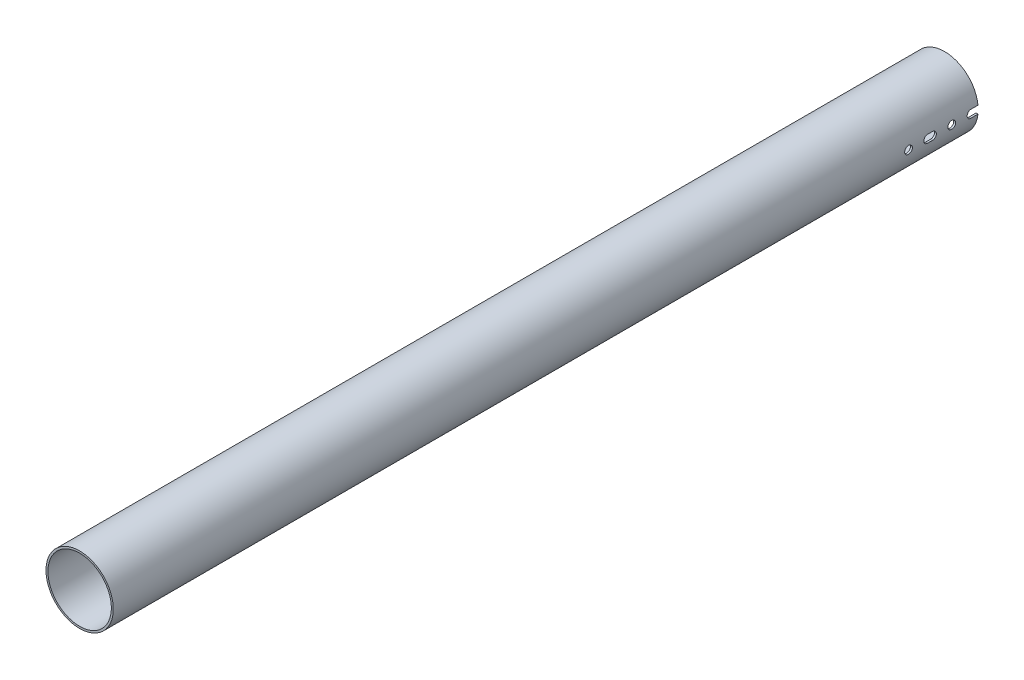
ISO-10303-21;
HEADER;
FILE_DESCRIPTION(('STEP AP214'),'2;1');
FILE_NAME('part.step','',(''),(''),'','','');
FILE_SCHEMA(('AUTOMOTIVE_DESIGN { 1 0 10303 214 1 1 1 1 }'));
ENDSEC;
DATA;
#1=APPLICATION_CONTEXT('core data for automotive mechanical design processes');
#2=APPLICATION_PROTOCOL_DEFINITION('international standard','automotive_design',2000,#1);
#3=PRODUCT_CONTEXT('',#1,'mechanical');
#4=PRODUCT('Part','Part','',(#3));
#5=PRODUCT_RELATED_PRODUCT_CATEGORY('part','',(#4));
#6=PRODUCT_DEFINITION_FORMATION('','',#4);
#7=PRODUCT_DEFINITION_CONTEXT('part definition',#1,'design');
#8=PRODUCT_DEFINITION('design','',#6,#7);
#9=PRODUCT_DEFINITION_SHAPE('','',#8);
#10=(LENGTH_UNIT() NAMED_UNIT(*) SI_UNIT(.MILLI.,.METRE.));
#11=(NAMED_UNIT(*) PLANE_ANGLE_UNIT() SI_UNIT($,.RADIAN.));
#12=(NAMED_UNIT(*) SI_UNIT($,.STERADIAN.) SOLID_ANGLE_UNIT());
#13=UNCERTAINTY_MEASURE_WITH_UNIT(LENGTH_MEASURE(1.E-05),#10,'distance_accuracy_value','');
#14=(GEOMETRIC_REPRESENTATION_CONTEXT(3) GLOBAL_UNCERTAINTY_ASSIGNED_CONTEXT((#13)) GLOBAL_UNIT_ASSIGNED_CONTEXT((#10,
#11,#12)) REPRESENTATION_CONTEXT('',''));
#15=CARTESIAN_POINT('',(0.,0.,0.));
#16=DIRECTION('',(0.,0.,1.));
#17=DIRECTION('',(1.,0.,0.));
#18=AXIS2_PLACEMENT_3D('',#15,#16,#17);
#19=CARTESIAN_POINT('',(0.,0.,360.));
#20=DIRECTION('',(0.,0.,-1.));
#21=DIRECTION('',(-1.,0.,0.));
#22=AXIS2_PLACEMENT_3D('',#19,#20,#21);
#23=CYLINDRICAL_SURFACE('',#22,13.2);
#24=DIRECTION('',(0.,0.,1.));
#25=VECTOR('',#24,1.);
#26=CARTESIAN_POINT('',(13.1026714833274,1.59999999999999,21.));
#27=LINE('',#26,#25);
#28=CARTESIAN_POINT('',(13.1026714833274,1.6,19.));
#29=VERTEX_POINT('',#28);
#30=CARTESIAN_POINT('',(13.1026714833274,1.6,21.));
#31=VERTEX_POINT('',#30);
#32=EDGE_CURVE('E178',#29,#31,#27,.T.);
#33=ORIENTED_EDGE('',*,*,#32,.T.);
#34=CARTESIAN_POINT('',(13.1026714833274,1.6,21.));
#35=CARTESIAN_POINT('',(13.1026701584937,1.59999989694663,21.0448383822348));
#36=CARTESIAN_POINT('',(13.1029019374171,1.59811398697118,21.0896551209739));
#37=CARTESIAN_POINT('',(13.1038177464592,1.59059161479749,21.1789646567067));
#38=CARTESIAN_POINT('',(13.1045017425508,1.58495543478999,21.2234574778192));
#39=CARTESIAN_POINT('',(13.107207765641,1.5624809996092,21.3558722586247));
#40=CARTESIAN_POINT('',(13.1098839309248,1.54007666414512,21.4429020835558));
#41=CARTESIAN_POINT('',(13.1166802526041,1.48107065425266,21.6119291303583));
#42=CARTESIAN_POINT('',(13.1208009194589,1.44446396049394,21.6939245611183));
#43=CARTESIAN_POINT('',(13.1300198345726,1.35810802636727,21.8506110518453));
#44=CARTESIAN_POINT('',(13.1351179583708,1.30836045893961,21.9253030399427));
#45=CARTESIAN_POINT('',(13.1457464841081,1.19686690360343,22.0656354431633));
#46=CARTESIAN_POINT('',(13.1512787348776,1.13506772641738,22.131233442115));
#47=CARTESIAN_POINT('',(13.1621375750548,1.00131287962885,22.2511766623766));
#48=CARTESIAN_POINT('',(13.1674640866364,0.929353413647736,22.305517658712));
#49=CARTESIAN_POINT('',(13.1773309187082,0.777039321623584,22.4015515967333));
#50=CARTESIAN_POINT('',(13.1818684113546,0.696656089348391,22.4431994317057));
#51=CARTESIAN_POINT('',(13.1896168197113,0.530033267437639,22.5123433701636));
#52=CARTESIAN_POINT('',(13.1928292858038,0.443800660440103,22.5398560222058));
#53=CARTESIAN_POINT('',(13.1967748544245,0.297583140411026,22.5732231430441));
#54=CARTESIAN_POINT('',(13.1979784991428,0.238529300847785,22.5832501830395));
#55=CARTESIAN_POINT('',(13.1995914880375,0.119658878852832,22.5966399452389));
#56=CARTESIAN_POINT('',(13.2000008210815,0.0598422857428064,22.6000025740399));
#57=CARTESIAN_POINT('',(13.1999987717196,-0.0895198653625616,22.5999961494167));
#58=CARTESIAN_POINT('',(13.1990796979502,-0.179097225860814,22.5924616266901));
#59=CARTESIAN_POINT('',(13.1955017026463,-0.35576045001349,22.5625228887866));
#60=CARTESIAN_POINT('',(13.1928409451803,-0.442843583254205,22.5401029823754));
#61=CARTESIAN_POINT('',(13.1860794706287,-0.611934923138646,22.4810627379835));
#62=CARTESIAN_POINT('',(13.1819797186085,-0.693946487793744,22.4444519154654));
#63=CARTESIAN_POINT('',(13.1727965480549,-0.850646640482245,22.3580883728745));
#64=CARTESIAN_POINT('',(13.1677132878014,-0.925336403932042,22.3083377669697));
#65=CARTESIAN_POINT('',(13.157101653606,-1.06567300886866,22.1968332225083));
#66=CARTESIAN_POINT('',(13.1515713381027,-1.13127663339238,22.1350250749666));
#67=CARTESIAN_POINT('',(13.1407043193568,-1.25120962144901,22.001270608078));
#68=CARTESIAN_POINT('',(13.1353676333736,-1.30553798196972,21.9293233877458));
#69=CARTESIAN_POINT('',(13.1254719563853,-1.4015460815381,21.7770458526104));
#70=CARTESIAN_POINT('',(13.1209156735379,-1.44318215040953,21.6966878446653));
#71=CARTESIAN_POINT('',(13.1131257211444,-1.51233338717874,21.5300671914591));
#72=CARTESIAN_POINT('',(13.1098913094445,-1.53985648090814,21.4438078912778));
#73=CARTESIAN_POINT('',(13.1059189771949,-1.57323476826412,21.2975260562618));
#74=CARTESIAN_POINT('',(13.1047072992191,-1.5832639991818,21.2384350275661));
#75=CARTESIAN_POINT('',(13.1030810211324,-1.59664660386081,21.1195713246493));
#76=CARTESIAN_POINT('',(13.1026653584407,-1.6000088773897,21.0597996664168));
#77=CARTESIAN_POINT('',(13.1026714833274,-1.6,21.));
#78=B_SPLINE_CURVE_WITH_KNOTS('',3,(#34,#35,#36,#37,#38,#39,#40,#41,#42,#43,#44,#45,#46,#47,#48,
#49,#50,#51,#52,#53,#54,#55,#56,#57,#58,#59,#60,#61,#62,#63,#64,#65,#66,#67,#68,#69,#70,#71,#72,
#73,#74,#75,#76,#77),.UNSPECIFIED.,.F.,.F.,(4,2,2,2,2,2,2,2,2,2,2,2,2,2,2,2,2,2,2,2,2,4),(0.,
0.13443200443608,0.268853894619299,0.537189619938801,0.805620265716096,1.07401675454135,
1.34362576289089,1.61333577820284,1.88399335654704,2.15433334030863,2.3337114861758,
2.51309214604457,2.78143304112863,3.05005725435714,3.31850165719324,3.58690289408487,
3.85653985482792,4.12620079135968,4.39677933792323,4.66720576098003,4.84669456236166,
5.02594360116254),.UNSPECIFIED.);
#79=CARTESIAN_POINT('',(13.1026714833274,-1.6,21.));
#80=VERTEX_POINT('',#79);
#81=EDGE_CURVE('E279',#31,#80,#78,.T.);
#82=ORIENTED_EDGE('',*,*,#81,.T.);
#83=DIRECTION('',(0.,0.,-1.));
#84=VECTOR('',#83,1.);
#85=CARTESIAN_POINT('',(13.1026714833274,-1.60000000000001,21.));
#86=LINE('',#85,#84);
#87=CARTESIAN_POINT('',(13.1026714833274,-1.6,19.));
#88=VERTEX_POINT('',#87);
#89=EDGE_CURVE('E183',#80,#88,#86,.T.);
#90=ORIENTED_EDGE('',*,*,#89,.T.);
#91=CARTESIAN_POINT('',(13.1026714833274,-1.6,19.));
#92=CARTESIAN_POINT('',(13.1026701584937,-1.59999989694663,18.9551616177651));
#93=CARTESIAN_POINT('',(13.1029019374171,-1.59811398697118,18.9103448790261));
#94=CARTESIAN_POINT('',(13.1038177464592,-1.59059161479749,18.8210353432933));
#95=CARTESIAN_POINT('',(13.1045017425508,-1.58495543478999,18.7765425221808));
#96=CARTESIAN_POINT('',(13.107207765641,-1.56248099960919,18.6441277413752));
#97=CARTESIAN_POINT('',(13.1098839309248,-1.54007666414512,18.5570979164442));
#98=CARTESIAN_POINT('',(13.1166802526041,-1.48107065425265,18.3880708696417));
#99=CARTESIAN_POINT('',(13.1208009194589,-1.44446396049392,18.3060754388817));
#100=CARTESIAN_POINT('',(13.1300198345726,-1.35810802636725,18.1493889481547));
#101=CARTESIAN_POINT('',(13.1351179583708,-1.30836045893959,18.0746969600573));
#102=CARTESIAN_POINT('',(13.1457464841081,-1.19686690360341,17.9343645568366));
#103=CARTESIAN_POINT('',(13.1512787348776,-1.13506772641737,17.868766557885));
#104=CARTESIAN_POINT('',(13.1621375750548,-1.00131287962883,17.7488233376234));
#105=CARTESIAN_POINT('',(13.1674640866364,-0.929353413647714,17.694482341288));
#106=CARTESIAN_POINT('',(13.1773309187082,-0.777039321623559,17.5984484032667));
#107=CARTESIAN_POINT('',(13.1818684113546,-0.696656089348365,17.5568005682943));
#108=CARTESIAN_POINT('',(13.1896168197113,-0.530033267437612,17.4876566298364));
#109=CARTESIAN_POINT('',(13.1928292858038,-0.443800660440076,17.4601439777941));
#110=CARTESIAN_POINT('',(13.1967748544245,-0.297583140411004,17.4267768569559));
#111=CARTESIAN_POINT('',(13.1979784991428,-0.238529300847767,17.4167498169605));
#112=CARTESIAN_POINT('',(13.1995914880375,-0.119658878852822,17.4033600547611));
#113=CARTESIAN_POINT('',(13.2000008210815,-0.0598422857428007,17.3999974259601));
#114=CARTESIAN_POINT('',(13.1999987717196,0.089519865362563,17.4000038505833));
#115=CARTESIAN_POINT('',(13.1990796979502,0.179097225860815,17.4075383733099));
#116=CARTESIAN_POINT('',(13.1955017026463,0.355760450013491,17.4374771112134));
#117=CARTESIAN_POINT('',(13.1928409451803,0.442843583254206,17.4598970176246));
#118=CARTESIAN_POINT('',(13.1860794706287,0.611934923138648,17.5189372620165));
#119=CARTESIAN_POINT('',(13.1819797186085,0.693946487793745,17.5555480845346));
#120=CARTESIAN_POINT('',(13.1727965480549,0.850646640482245,17.6419116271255));
#121=CARTESIAN_POINT('',(13.1677132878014,0.925336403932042,17.6916622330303));
#122=CARTESIAN_POINT('',(13.157101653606,1.06567300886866,17.8031667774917));
#123=CARTESIAN_POINT('',(13.1515713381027,1.13127663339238,17.8649749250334));
#124=CARTESIAN_POINT('',(13.1407043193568,1.25120962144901,17.998729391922));
#125=CARTESIAN_POINT('',(13.1353676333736,1.30553798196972,18.0706766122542));
#126=CARTESIAN_POINT('',(13.1254719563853,1.4015460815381,18.2229541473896));
#127=CARTESIAN_POINT('',(13.1209156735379,1.44318215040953,18.3033121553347));
#128=CARTESIAN_POINT('',(13.1131257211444,1.51233338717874,18.4699328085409));
#129=CARTESIAN_POINT('',(13.1098913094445,1.53985648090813,18.5561921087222));
#130=CARTESIAN_POINT('',(13.1059189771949,1.57323476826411,18.7024739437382));
#131=CARTESIAN_POINT('',(13.1047072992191,1.58326399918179,18.7615649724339));
#132=CARTESIAN_POINT('',(13.1030810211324,1.59664660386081,18.8804286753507));
#133=CARTESIAN_POINT('',(13.1026653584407,1.6000088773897,18.9402003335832));
#134=CARTESIAN_POINT('',(13.1026714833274,1.6,19.));
#135=B_SPLINE_CURVE_WITH_KNOTS('',3,(#91,#92,#93,#94,#95,#96,#97,#98,#99,#100,#101,#102,#103,
#104,#105,#106,#107,#108,#109,#110,#111,#112,#113,#114,#115,#116,#117,#118,#119,#120,#121,#122,
#123,#124,#125,#126,#127,#128,#129,#130,#131,#132,#133,#134),.UNSPECIFIED.,.F.,.F.,(4,2,2,2,2,2,
2,2,2,2,2,2,2,2,2,2,2,2,2,2,2,4),(0.,0.13443200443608,0.2688538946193,0.5371896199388,
0.805620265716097,1.07401675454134,1.34362576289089,1.61333577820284,1.88399335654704,
2.15433334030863,2.33371148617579,2.51309214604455,2.78143304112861,3.05005725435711,
3.31850165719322,3.58690289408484,3.85653985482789,4.12620079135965,4.3967793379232,
4.66720576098,4.84669456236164,5.02594360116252),.UNSPECIFIED.);
#136=EDGE_CURVE('E267',#88,#29,#135,.T.);
#137=ORIENTED_EDGE('',*,*,#136,.T.);
#138=EDGE_LOOP('',(#33,#82,#90,#137));
#139=FACE_BOUND('',#138,.T.);
#140=CARTESIAN_POINT('',(13.2,0.,9.4));
#141=CARTESIAN_POINT('',(13.1999987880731,0.0894390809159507,9.40000392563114));
#142=CARTESIAN_POINT('',(13.1990806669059,0.178995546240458,9.40753057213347));
#143=CARTESIAN_POINT('',(13.1955044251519,0.35568000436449,9.43745403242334));
#144=CARTESIAN_POINT('',(13.1928426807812,0.442802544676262,9.45988181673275));
#145=CARTESIAN_POINT('',(13.1860790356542,0.611943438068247,9.51894110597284));
#146=CARTESIAN_POINT('',(13.181978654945,0.693967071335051,9.5555576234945));
#147=CARTESIAN_POINT('',(13.1727952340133,0.850666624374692,9.64192444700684));
#148=CARTESIAN_POINT('',(13.1677126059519,0.925345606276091,9.69166924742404));
#149=CARTESIAN_POINT('',(13.1571016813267,1.06567245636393,9.80316663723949));
#150=CARTESIAN_POINT('',(13.1515713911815,1.13127595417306,9.86497488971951));
#151=CARTESIAN_POINT('',(13.140704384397,1.25120899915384,9.99872797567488));
#152=CARTESIAN_POINT('',(13.1353676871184,1.3055374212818,10.0706738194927));
#153=CARTESIAN_POINT('',(13.1254732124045,1.40153393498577,10.2229367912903));
#154=CARTESIAN_POINT('',(13.1209179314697,1.44316176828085,10.3032794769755));
#155=CARTESIAN_POINT('',(13.1131275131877,1.51231782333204,10.4698788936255));
#156=CARTESIAN_POINT('',(13.1098923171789,1.53984667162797,10.5561353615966));
#157=CARTESIAN_POINT('',(13.1051268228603,1.57989233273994,10.7316647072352));
#158=CARTESIAN_POINT('',(13.1035882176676,1.5924823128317,10.8209206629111));
#159=CARTESIAN_POINT('',(13.1023646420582,1.60251921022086,11.0002910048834));
#160=CARTESIAN_POINT('',(13.1026796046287,1.59996667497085,11.0904053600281));
#161=CARTESIAN_POINT('',(13.1051199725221,1.57985114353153,11.2684244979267));
#162=CARTESIAN_POINT('',(13.1072356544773,1.56236876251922,11.3563385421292));
#163=CARTESIAN_POINT('',(13.113023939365,1.5130152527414,11.5279765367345));
#164=CARTESIAN_POINT('',(13.1166965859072,1.48114372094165,11.6117003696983));
#165=CARTESIAN_POINT('',(13.1251961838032,1.40382834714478,11.7728342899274));
#166=CARTESIAN_POINT('',(13.1300261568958,1.35834889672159,11.8502271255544));
#167=CARTESIAN_POINT('',(13.1402933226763,1.25513813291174,11.9963062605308));
#168=CARTESIAN_POINT('',(13.1457304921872,1.19740728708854,12.0649928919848));
#169=CARTESIAN_POINT('',(13.1566419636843,1.07089675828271,12.1921728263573));
#170=CARTESIAN_POINT('',(13.1621162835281,1.00204966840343,12.2505990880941));
#171=CARTESIAN_POINT('',(13.1724557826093,0.855452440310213,12.3551034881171));
#172=CARTESIAN_POINT('',(13.1773206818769,0.777698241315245,12.4011759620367));
#173=CARTESIAN_POINT('',(13.1858963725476,0.615422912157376,12.4796595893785));
#174=CARTESIAN_POINT('',(13.1896058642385,0.530894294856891,12.5120553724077));
#175=CARTESIAN_POINT('',(13.1954368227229,0.357656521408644,12.5621075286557));
#176=CARTESIAN_POINT('',(13.1975616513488,0.268956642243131,12.5797951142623));
#177=CARTESIAN_POINT('',(13.1991850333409,0.149709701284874,12.5932641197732));
#178=CARTESIAN_POINT('',(13.199490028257,0.119827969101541,12.5957881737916));
#179=CARTESIAN_POINT('',(13.1998977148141,0.0599685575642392,12.5991567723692));
#180=CARTESIAN_POINT('',(13.2000004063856,0.0299908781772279,12.6000013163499));
#181=CARTESIAN_POINT('',(13.1999987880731,-0.0894390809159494,12.5999960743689));
#182=CARTESIAN_POINT('',(13.1990806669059,-0.178995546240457,12.5924694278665));
#183=CARTESIAN_POINT('',(13.1955044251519,-0.355680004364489,12.5625459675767));
#184=CARTESIAN_POINT('',(13.1928426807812,-0.442802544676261,12.5401181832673));
#185=CARTESIAN_POINT('',(13.1860790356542,-0.611943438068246,12.4810588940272));
#186=CARTESIAN_POINT('',(13.181978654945,-0.69396707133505,12.4444423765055));
#187=CARTESIAN_POINT('',(13.1727952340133,-0.85066662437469,12.3580755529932));
#188=CARTESIAN_POINT('',(13.1677126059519,-0.925345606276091,12.308330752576));
#189=CARTESIAN_POINT('',(13.1571016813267,-1.06567245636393,12.1968333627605));
#190=CARTESIAN_POINT('',(13.1515713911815,-1.13127595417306,12.1350251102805));
#191=CARTESIAN_POINT('',(13.140704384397,-1.25120899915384,12.0012720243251));
#192=CARTESIAN_POINT('',(13.1353676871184,-1.3055374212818,11.9293261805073));
#193=CARTESIAN_POINT('',(13.1254732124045,-1.40153393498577,11.7770632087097));
#194=CARTESIAN_POINT('',(13.1209179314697,-1.44316176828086,11.6967205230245));
#195=CARTESIAN_POINT('',(13.1131275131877,-1.51231782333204,11.5301211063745));
#196=CARTESIAN_POINT('',(13.1098923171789,-1.53984667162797,11.4438646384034));
#197=CARTESIAN_POINT('',(13.1051268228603,-1.57989233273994,11.2683352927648));
#198=CARTESIAN_POINT('',(13.1035882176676,-1.59248231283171,11.1790793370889));
#199=CARTESIAN_POINT('',(13.1023646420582,-1.60251921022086,10.9997089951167));
#200=CARTESIAN_POINT('',(13.1026796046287,-1.59996667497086,10.9095946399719));
#201=CARTESIAN_POINT('',(13.1051199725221,-1.57985114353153,10.7315755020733));
#202=CARTESIAN_POINT('',(13.1072356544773,-1.56236876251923,10.6436614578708));
#203=CARTESIAN_POINT('',(13.113023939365,-1.5130152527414,10.4720234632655));
#204=CARTESIAN_POINT('',(13.1166965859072,-1.48114372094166,10.3882996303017));
#205=CARTESIAN_POINT('',(13.1251961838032,-1.40382834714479,10.2271657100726));
#206=CARTESIAN_POINT('',(13.1300261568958,-1.3583488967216,10.1497728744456));
#207=CARTESIAN_POINT('',(13.1402933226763,-1.25513813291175,10.0036937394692));
#208=CARTESIAN_POINT('',(13.1457304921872,-1.19740728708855,9.9350071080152));
#209=CARTESIAN_POINT('',(13.1566419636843,-1.07089675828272,9.80782717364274));
#210=CARTESIAN_POINT('',(13.1621162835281,-1.00204966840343,9.74940091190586));
#211=CARTESIAN_POINT('',(13.1724557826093,-0.855452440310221,9.64489651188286));
#212=CARTESIAN_POINT('',(13.1773206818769,-0.777698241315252,9.59882403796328));
#213=CARTESIAN_POINT('',(13.1858963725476,-0.615422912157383,9.52034041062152));
#214=CARTESIAN_POINT('',(13.1896058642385,-0.530894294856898,9.48794462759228));
#215=CARTESIAN_POINT('',(13.1954368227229,-0.357656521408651,9.43789247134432));
#216=CARTESIAN_POINT('',(13.1975616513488,-0.268956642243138,9.42020488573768));
#217=CARTESIAN_POINT('',(13.1991850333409,-0.149709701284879,9.40673588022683));
#218=CARTESIAN_POINT('',(13.199490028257,-0.119827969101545,9.40421182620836));
#219=CARTESIAN_POINT('',(13.1998977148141,-0.0599685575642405,9.40084322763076));
#220=CARTESIAN_POINT('',(13.2000004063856,-0.0299908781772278,9.3999986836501));
#221=CARTESIAN_POINT('',(13.2,0.,9.4));
#222=B_SPLINE_CURVE_WITH_KNOTS('',3,(#140,#141,#142,#143,#144,#145,#146,#147,#148,#149,#150,
#151,#152,#153,#154,#155,#156,#157,#158,#159,#160,#161,#162,#163,#164,#165,#166,#167,#168,#169,
#170,#171,#172,#173,#174,#175,#176,#177,#178,#179,#180,#181,#182,#183,#184,#185,#186,#187,#188,
#189,#190,#191,#192,#193,#194,#195,#196,#197,#198,#199,#200,#201,#202,#203,#204,#205,#206,#207,
#208,#209,#210,#211,#212,#213,#214,#215,#216,#217,#218,#219,#220,#221),.UNSPECIFIED.,.T.,.F.,(4,
2,2,2,2,2,2,2,2,2,2,2,2,2,2,2,2,2,2,2,2,2,2,2,2,2,2,2,2,2,2,2,2,2,2,2,2,2,2,2,4),(0.,
0.268202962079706,0.536965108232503,0.805444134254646,1.07381074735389,1.34344625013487,
1.61310864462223,1.88361713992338,2.15411361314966,2.42327971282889,2.6924360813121,
2.96014823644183,3.22786789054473,3.49629431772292,3.76471050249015,4.03482006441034,
4.30505326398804,4.5755893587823,4.84554987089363,4.93548415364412,5.0254184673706,
5.29362142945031,5.56238357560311,5.83086260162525,6.09922921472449,6.36886471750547,
6.63852711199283,6.90903560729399,7.17953208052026,7.44869818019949,7.7178545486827,
7.98556670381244,8.25328635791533,8.52171278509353,8.79012896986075,9.06023853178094,
9.33047173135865,9.60100782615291,9.87096833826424,9.96090262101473,10.0508369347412),.UNSPECIFIED.);
#223=CARTESIAN_POINT('',(13.2,0.,9.4));
#224=VERTEX_POINT('',#223);
#225=EDGE_CURVE('E274',#224,#224,#222,.T.);
#226=ORIENTED_EDGE('',*,*,#225,.T.);
#227=EDGE_LOOP('',(#226));
#228=FACE_BOUND('',#227,.T.);
#229=DIRECTION('',(0.,0.,1.));
#230=VECTOR('',#229,1.);
#231=CARTESIAN_POINT('',(13.1026714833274,1.6,3.));
#232=LINE('',#231,#230);
#233=CARTESIAN_POINT('',(13.1026714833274,1.6,0.));
#234=VERTEX_POINT('',#233);
#235=CARTESIAN_POINT('',(13.1026714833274,1.6,3.));
#236=VERTEX_POINT('',#235);
#237=EDGE_CURVE('E170',#234,#236,#232,.T.);
#238=ORIENTED_EDGE('',*,*,#237,.T.);
#239=CARTESIAN_POINT('',(13.1026714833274,1.6,3.));
#240=CARTESIAN_POINT('',(13.1026701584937,1.59999989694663,3.04483838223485));
#241=CARTESIAN_POINT('',(13.1029019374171,1.59811398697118,3.08965512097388));
#242=CARTESIAN_POINT('',(13.1038177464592,1.59059161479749,3.1789646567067));
#243=CARTESIAN_POINT('',(13.1045017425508,1.58495543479,3.22345747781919));
#244=CARTESIAN_POINT('',(13.107207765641,1.5624809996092,3.35587225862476));
#245=CARTESIAN_POINT('',(13.1098839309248,1.54007666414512,3.4429020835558));
#246=CARTESIAN_POINT('',(13.1166802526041,1.48107065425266,3.61192913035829));
#247=CARTESIAN_POINT('',(13.1208009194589,1.44446396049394,3.69392456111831));
#248=CARTESIAN_POINT('',(13.1300198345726,1.35810802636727,3.85061105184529));
#249=CARTESIAN_POINT('',(13.1351179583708,1.30836045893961,3.92530303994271));
#250=CARTESIAN_POINT('',(13.1457464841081,1.19686690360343,4.06563544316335));
#251=CARTESIAN_POINT('',(13.1512787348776,1.13506772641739,4.13123344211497));
#252=CARTESIAN_POINT('',(13.1621375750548,1.00131287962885,4.25117666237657));
#253=CARTESIAN_POINT('',(13.1674640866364,0.929353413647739,4.30551765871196));
#254=CARTESIAN_POINT('',(13.1773309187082,0.777039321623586,4.40155159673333));
#255=CARTESIAN_POINT('',(13.1818684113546,0.696656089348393,4.4431994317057));
#256=CARTESIAN_POINT('',(13.1896168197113,0.530033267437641,4.51234337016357));
#257=CARTESIAN_POINT('',(13.1928292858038,0.443800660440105,4.53985602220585));
#258=CARTESIAN_POINT('',(13.1967748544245,0.297583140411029,4.57322314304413));
#259=CARTESIAN_POINT('',(13.1979784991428,0.238529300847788,4.58325018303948));
#260=CARTESIAN_POINT('',(13.1995914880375,0.119658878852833,4.59663994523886));
#261=CARTESIAN_POINT('',(13.2000008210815,0.059842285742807,4.60000257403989));
#262=CARTESIAN_POINT('',(13.1999987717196,-0.0895198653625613,4.59999614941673));
#263=CARTESIAN_POINT('',(13.1990796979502,-0.179097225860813,4.59246162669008));
#264=CARTESIAN_POINT('',(13.1955017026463,-0.355760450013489,4.56252288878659));
#265=CARTESIAN_POINT('',(13.1928409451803,-0.442843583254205,4.54010298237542));
#266=CARTESIAN_POINT('',(13.1860794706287,-0.611934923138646,4.48106273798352));
#267=CARTESIAN_POINT('',(13.1819797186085,-0.693946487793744,4.44445191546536));
#268=CARTESIAN_POINT('',(13.1727965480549,-0.850646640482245,4.3580883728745));
#269=CARTESIAN_POINT('',(13.1677132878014,-0.925336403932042,4.3083377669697));
#270=CARTESIAN_POINT('',(13.157101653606,-1.06567300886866,4.19683322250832));
#271=CARTESIAN_POINT('',(13.1515713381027,-1.13127663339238,4.13502507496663));
#272=CARTESIAN_POINT('',(13.1407043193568,-1.25120962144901,4.00127060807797));
#273=CARTESIAN_POINT('',(13.1353676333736,-1.30553798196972,3.92932338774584));
#274=CARTESIAN_POINT('',(13.1254719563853,-1.4015460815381,3.77704585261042));
#275=CARTESIAN_POINT('',(13.1209156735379,-1.44318215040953,3.69668784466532));
#276=CARTESIAN_POINT('',(13.1131257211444,-1.51233338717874,3.53006719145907));
#277=CARTESIAN_POINT('',(13.1098913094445,-1.53985648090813,3.44380789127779));
#278=CARTESIAN_POINT('',(13.1059189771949,-1.57323476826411,3.2975260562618));
#279=CARTESIAN_POINT('',(13.1047072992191,-1.58326399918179,3.23843502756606));
#280=CARTESIAN_POINT('',(13.1030810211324,-1.59664660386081,3.11957132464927));
#281=CARTESIAN_POINT('',(13.1026653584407,-1.6000088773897,3.0597996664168));
#282=CARTESIAN_POINT('',(13.1026714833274,-1.6,3.));
#283=B_SPLINE_CURVE_WITH_KNOTS('',3,(#239,#240,#241,#242,#243,#244,#245,#246,#247,#248,#249,
#250,#251,#252,#253,#254,#255,#256,#257,#258,#259,#260,#261,#262,#263,#264,#265,#266,#267,#268,
#269,#270,#271,#272,#273,#274,#275,#276,#277,#278,#279,#280,#281,#282),.UNSPECIFIED.,.F.,.F.,(4,
2,2,2,2,2,2,2,2,2,2,2,2,2,2,2,2,2,2,2,2,4),(0.,0.134432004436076,0.268853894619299,
0.537189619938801,0.805620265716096,1.07401675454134,1.34362576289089,1.61333577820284,
1.88399335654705,2.15433334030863,2.3337114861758,2.51309214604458,2.78143304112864,
3.05005725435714,3.31850165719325,3.58690289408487,3.85653985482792,4.12620079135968,
4.39677933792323,4.66720576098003,4.84669456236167,5.02594360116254),.UNSPECIFIED.);
#284=CARTESIAN_POINT('',(13.1026714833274,-1.6,3.));
#285=VERTEX_POINT('',#284);
#286=EDGE_CURVE('E379',#236,#285,#283,.T.);
#287=ORIENTED_EDGE('',*,*,#286,.T.);
#288=DIRECTION('',(0.,0.,-1.));
#289=VECTOR('',#288,1.);
#290=CARTESIAN_POINT('',(13.1026714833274,-1.6,3.));
#291=LINE('',#290,#289);
#292=CARTESIAN_POINT('',(13.1026714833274,-1.6,0.));
#293=VERTEX_POINT('',#292);
#294=EDGE_CURVE('E175',#285,#293,#291,.T.);
#295=ORIENTED_EDGE('',*,*,#294,.T.);
#296=CARTESIAN_POINT('',(0.,0.,0.));
#297=DIRECTION('',(0.,0.,-1.));
#298=DIRECTION('',(-1.,0.,0.));
#299=AXIS2_PLACEMENT_3D('',#296,#297,#298);
#300=CIRCLE('',#299,13.2);
#301=CARTESIAN_POINT('',(-13.1026714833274,-1.6,0.));
#302=VERTEX_POINT('',#301);
#303=EDGE_CURVE('E21',#293,#302,#300,.T.);
#304=ORIENTED_EDGE('',*,*,#303,.T.);
#305=DIRECTION('',(0.,0.,-1.));
#306=VECTOR('',#305,1.);
#307=CARTESIAN_POINT('',(-13.1026714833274,-1.6,3.));
#308=LINE('',#307,#306);
#309=CARTESIAN_POINT('',(-13.1026714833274,-1.6,3.));
#310=VERTEX_POINT('',#309);
#311=EDGE_CURVE('E157',#302,#310,#308,.F.);
#312=ORIENTED_EDGE('',*,*,#311,.T.);
#313=CARTESIAN_POINT('',(-13.1026714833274,-1.6,3.));
#314=CARTESIAN_POINT('',(-13.1026701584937,-1.59999989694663,3.04483838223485));
#315=CARTESIAN_POINT('',(-13.1029019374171,-1.59811398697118,3.08965512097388));
#316=CARTESIAN_POINT('',(-13.1038177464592,-1.59059161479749,3.1789646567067));
#317=CARTESIAN_POINT('',(-13.1045017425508,-1.58495543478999,3.22345747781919));
#318=CARTESIAN_POINT('',(-13.107207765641,-1.5624809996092,3.35587225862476));
#319=CARTESIAN_POINT('',(-13.1098839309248,-1.54007666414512,3.4429020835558));
#320=CARTESIAN_POINT('',(-13.1166802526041,-1.48107065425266,3.61192913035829));
#321=CARTESIAN_POINT('',(-13.1208009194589,-1.44446396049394,3.69392456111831));
#322=CARTESIAN_POINT('',(-13.1300198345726,-1.35810802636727,3.85061105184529));
#323=CARTESIAN_POINT('',(-13.1351179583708,-1.30836045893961,3.92530303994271));
#324=CARTESIAN_POINT('',(-13.1457464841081,-1.19686690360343,4.06563544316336));
#325=CARTESIAN_POINT('',(-13.1512787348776,-1.13506772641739,4.13123344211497));
#326=CARTESIAN_POINT('',(-13.1621375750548,-1.00131287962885,4.25117666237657));
#327=CARTESIAN_POINT('',(-13.1674640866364,-0.929353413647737,4.30551765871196));
#328=CARTESIAN_POINT('',(-13.1773309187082,-0.777039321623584,4.40155159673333));
#329=CARTESIAN_POINT('',(-13.1818684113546,-0.69665608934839,4.4431994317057));
#330=CARTESIAN_POINT('',(-13.1896168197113,-0.530033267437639,4.51234337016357));
#331=CARTESIAN_POINT('',(-13.1928292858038,-0.443800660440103,4.53985602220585));
#332=CARTESIAN_POINT('',(-13.1967748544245,-0.297583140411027,4.57322314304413));
#333=CARTESIAN_POINT('',(-13.1979784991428,-0.238529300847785,4.58325018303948));
#334=CARTESIAN_POINT('',(-13.1995914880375,-0.119658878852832,4.59663994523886));
#335=CARTESIAN_POINT('',(-13.2000008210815,-0.0598422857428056,4.60000257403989));
#336=CARTESIAN_POINT('',(-13.1999987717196,0.0895198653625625,4.59999614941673));
#337=CARTESIAN_POINT('',(-13.1990796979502,0.179097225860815,4.59246162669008));
#338=CARTESIAN_POINT('',(-13.1955017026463,0.35576045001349,4.56252288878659));
#339=CARTESIAN_POINT('',(-13.1928409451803,0.442843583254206,4.54010298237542));
#340=CARTESIAN_POINT('',(-13.1860794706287,0.611934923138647,4.48106273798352));
#341=CARTESIAN_POINT('',(-13.1819797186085,0.693946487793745,4.44445191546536));
#342=CARTESIAN_POINT('',(-13.1727965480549,0.850646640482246,4.3580883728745));
#343=CARTESIAN_POINT('',(-13.1677132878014,0.925336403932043,4.3083377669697));
#344=CARTESIAN_POINT('',(-13.157101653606,1.06567300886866,4.19683322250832));
#345=CARTESIAN_POINT('',(-13.1515713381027,1.13127663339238,4.13502507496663));
#346=CARTESIAN_POINT('',(-13.1407043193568,1.25120962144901,4.00127060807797));
#347=CARTESIAN_POINT('',(-13.1353676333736,1.30553798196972,3.92932338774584));
#348=CARTESIAN_POINT('',(-13.1254719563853,1.4015460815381,3.77704585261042));
#349=CARTESIAN_POINT('',(-13.1209156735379,1.44318215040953,3.69668784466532));
#350=CARTESIAN_POINT('',(-13.1131257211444,1.51233338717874,3.53006719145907));
#351=CARTESIAN_POINT('',(-13.1098913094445,1.53985648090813,3.44380789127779));
#352=CARTESIAN_POINT('',(-13.1059189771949,1.57323476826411,3.2975260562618));
#353=CARTESIAN_POINT('',(-13.1047072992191,1.58326399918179,3.23843502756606));
#354=CARTESIAN_POINT('',(-13.1030810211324,1.59664660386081,3.11957132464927));
#355=CARTESIAN_POINT('',(-13.1026653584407,1.6000088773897,3.0597996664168));
#356=CARTESIAN_POINT('',(-13.1026714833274,1.6,3.));
#357=B_SPLINE_CURVE_WITH_KNOTS('',3,(#313,#314,#315,#316,#317,#318,#319,#320,#321,#322,#323,
#324,#325,#326,#327,#328,#329,#330,#331,#332,#333,#334,#335,#336,#337,#338,#339,#340,#341,#342,
#343,#344,#345,#346,#347,#348,#349,#350,#351,#352,#353,#354,#355,#356),.UNSPECIFIED.,.F.,.F.,(4,
2,2,2,2,2,2,2,2,2,2,2,2,2,2,2,2,2,2,2,2,4),(0.,0.134432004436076,0.268853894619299,
0.537189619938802,0.805620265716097,1.07401675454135,1.34362576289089,1.61333577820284,
1.88399335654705,2.15433334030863,2.3337114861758,2.51309214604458,2.78143304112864,
3.05005725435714,3.31850165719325,3.58690289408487,3.85653985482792,4.12620079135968,
4.39677933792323,4.66720576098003,4.84669456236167,5.02594360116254),.UNSPECIFIED.);
#358=CARTESIAN_POINT('',(-13.1026714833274,1.6,3.));
#359=VERTEX_POINT('',#358);
#360=EDGE_CURVE('E337',#310,#359,#357,.T.);
#361=ORIENTED_EDGE('',*,*,#360,.T.);
#362=DIRECTION('',(0.,0.,1.));
#363=VECTOR('',#362,1.);
#364=CARTESIAN_POINT('',(-13.1026714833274,1.6,3.));
#365=LINE('',#364,#363);
#366=CARTESIAN_POINT('',(-13.1026714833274,1.6,0.));
#367=VERTEX_POINT('',#366);
#368=EDGE_CURVE('E166',#359,#367,#365,.F.);
#369=ORIENTED_EDGE('',*,*,#368,.T.);
#370=CARTESIAN_POINT('',(0.,0.,0.));
#371=DIRECTION('',(0.,0.,-1.));
#372=DIRECTION('',(-1.,0.,0.));
#373=AXIS2_PLACEMENT_3D('',#370,#371,#372);
#374=CIRCLE('',#373,13.2);
#375=EDGE_CURVE('E383',#367,#234,#374,.T.);
#376=ORIENTED_EDGE('',*,*,#375,.T.);
#377=EDGE_LOOP('',(#238,#287,#295,#304,#312,#361,#369,#376));
#378=FACE_BOUND('',#377,.T.);
#379=CARTESIAN_POINT('',(-13.2,0.,12.6));
#380=CARTESIAN_POINT('',(-13.1999987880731,0.0894390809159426,12.5999960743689));
#381=CARTESIAN_POINT('',(-13.1990806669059,0.17899554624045,12.5924694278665));
#382=CARTESIAN_POINT('',(-13.1955044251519,0.355680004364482,12.5625459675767));
#383=CARTESIAN_POINT('',(-13.1928426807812,0.442802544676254,12.5401181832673));
#384=CARTESIAN_POINT('',(-13.1860790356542,0.61194343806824,12.4810588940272));
#385=CARTESIAN_POINT('',(-13.181978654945,0.693967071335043,12.4444423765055));
#386=CARTESIAN_POINT('',(-13.1727952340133,0.850666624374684,12.3580755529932));
#387=CARTESIAN_POINT('',(-13.1677126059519,0.925345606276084,12.308330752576));
#388=CARTESIAN_POINT('',(-13.1571016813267,1.06567245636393,12.1968333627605));
#389=CARTESIAN_POINT('',(-13.1515713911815,1.13127595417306,12.1350251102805));
#390=CARTESIAN_POINT('',(-13.140704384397,1.25120899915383,12.0012720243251));
#391=CARTESIAN_POINT('',(-13.1353676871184,1.3055374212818,11.9293261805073));
#392=CARTESIAN_POINT('',(-13.1254732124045,1.40153393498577,11.7770632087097));
#393=CARTESIAN_POINT('',(-13.1209179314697,1.44316176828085,11.6967205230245));
#394=CARTESIAN_POINT('',(-13.1131275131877,1.51231782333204,11.5301211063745));
#395=CARTESIAN_POINT('',(-13.1098923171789,1.53984667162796,11.4438646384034));
#396=CARTESIAN_POINT('',(-13.1051268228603,1.57989233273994,11.2683352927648));
#397=CARTESIAN_POINT('',(-13.1035882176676,1.5924823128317,11.1790793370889));
#398=CARTESIAN_POINT('',(-13.1023646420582,1.60251921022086,10.9997089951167));
#399=CARTESIAN_POINT('',(-13.1026796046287,1.59996667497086,10.9095946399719));
#400=CARTESIAN_POINT('',(-13.1051199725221,1.57985114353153,10.7315755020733));
#401=CARTESIAN_POINT('',(-13.1072356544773,1.56236876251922,10.6436614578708));
#402=CARTESIAN_POINT('',(-13.113023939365,1.5130152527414,10.4720234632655));
#403=CARTESIAN_POINT('',(-13.1166965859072,1.48114372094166,10.3882996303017));
#404=CARTESIAN_POINT('',(-13.1251961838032,1.40382834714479,10.2271657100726));
#405=CARTESIAN_POINT('',(-13.1300261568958,1.3583488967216,10.1497728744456));
#406=CARTESIAN_POINT('',(-13.1402933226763,1.25513813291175,10.0036937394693));
#407=CARTESIAN_POINT('',(-13.1457304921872,1.19740728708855,9.93500710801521));
#408=CARTESIAN_POINT('',(-13.1566419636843,1.07089675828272,9.80782717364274));
#409=CARTESIAN_POINT('',(-13.1621162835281,1.00204966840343,9.74940091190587));
#410=CARTESIAN_POINT('',(-13.1724557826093,0.855452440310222,9.64489651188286));
#411=CARTESIAN_POINT('',(-13.1773206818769,0.777698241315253,9.59882403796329));
#412=CARTESIAN_POINT('',(-13.1858963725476,0.615422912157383,9.52034041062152));
#413=CARTESIAN_POINT('',(-13.1896058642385,0.530894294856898,9.48794462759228));
#414=CARTESIAN_POINT('',(-13.1954368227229,0.357656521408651,9.43789247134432));
#415=CARTESIAN_POINT('',(-13.1975616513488,0.268956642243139,9.42020488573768));
#416=CARTESIAN_POINT('',(-13.1991850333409,0.149709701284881,9.40673588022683));
#417=CARTESIAN_POINT('',(-13.199490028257,0.119827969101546,9.40421182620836));
#418=CARTESIAN_POINT('',(-13.1998977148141,0.0599685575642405,9.40084322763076));
#419=CARTESIAN_POINT('',(-13.2000004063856,0.0299908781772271,9.3999986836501));
#420=CARTESIAN_POINT('',(-13.1999987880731,-0.0894390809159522,9.40000392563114));
#421=CARTESIAN_POINT('',(-13.1990806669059,-0.17899554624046,9.40753057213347));
#422=CARTESIAN_POINT('',(-13.1955044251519,-0.355680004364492,9.43745403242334));
#423=CARTESIAN_POINT('',(-13.1928426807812,-0.442802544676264,9.45988181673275));
#424=CARTESIAN_POINT('',(-13.1860790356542,-0.611943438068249,9.51894110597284));
#425=CARTESIAN_POINT('',(-13.181978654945,-0.693967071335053,9.5555576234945));
#426=CARTESIAN_POINT('',(-13.1727952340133,-0.850666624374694,9.64192444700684));
#427=CARTESIAN_POINT('',(-13.1677126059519,-0.925345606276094,9.69166924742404));
#428=CARTESIAN_POINT('',(-13.1571016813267,-1.06567245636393,9.80316663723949));
#429=CARTESIAN_POINT('',(-13.1515713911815,-1.13127595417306,9.86497488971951));
#430=CARTESIAN_POINT('',(-13.140704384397,-1.25120899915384,9.99872797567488));
#431=CARTESIAN_POINT('',(-13.1353676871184,-1.30553742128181,10.0706738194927));
#432=CARTESIAN_POINT('',(-13.1254732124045,-1.40153393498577,10.2229367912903));
#433=CARTESIAN_POINT('',(-13.1209179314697,-1.44316176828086,10.3032794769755));
#434=CARTESIAN_POINT('',(-13.1131275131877,-1.51231782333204,10.4698788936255));
#435=CARTESIAN_POINT('',(-13.1098923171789,-1.53984667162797,10.5561353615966));
#436=CARTESIAN_POINT('',(-13.1051268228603,-1.57989233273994,10.7316647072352));
#437=CARTESIAN_POINT('',(-13.1035882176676,-1.59248231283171,10.8209206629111));
#438=CARTESIAN_POINT('',(-13.1023646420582,-1.60251921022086,11.0002910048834));
#439=CARTESIAN_POINT('',(-13.1026796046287,-1.59996667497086,11.0904053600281));
#440=CARTESIAN_POINT('',(-13.1051199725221,-1.57985114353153,11.2684244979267));
#441=CARTESIAN_POINT('',(-13.1072356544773,-1.56236876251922,11.3563385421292));
#442=CARTESIAN_POINT('',(-13.113023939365,-1.5130152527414,11.5279765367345));
#443=CARTESIAN_POINT('',(-13.1166965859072,-1.48114372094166,11.6117003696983));
#444=CARTESIAN_POINT('',(-13.1251961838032,-1.40382834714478,11.7728342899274));
#445=CARTESIAN_POINT('',(-13.1300261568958,-1.3583488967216,11.8502271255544));
#446=CARTESIAN_POINT('',(-13.1402933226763,-1.25513813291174,11.9963062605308));
#447=CARTESIAN_POINT('',(-13.1457304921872,-1.19740728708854,12.0649928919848));
#448=CARTESIAN_POINT('',(-13.1566419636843,-1.07089675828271,12.1921728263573));
#449=CARTESIAN_POINT('',(-13.1621162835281,-1.00204966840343,12.2505990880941));
#450=CARTESIAN_POINT('',(-13.1724557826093,-0.855452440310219,12.3551034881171));
#451=CARTESIAN_POINT('',(-13.1773206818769,-0.77769824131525,12.4011759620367));
#452=CARTESIAN_POINT('',(-13.1858963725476,-0.61542291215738,12.4796595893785));
#453=CARTESIAN_POINT('',(-13.1896058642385,-0.530894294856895,12.5120553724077));
#454=CARTESIAN_POINT('',(-13.1954368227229,-0.357656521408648,12.5621075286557));
#455=CARTESIAN_POINT('',(-13.1975616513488,-0.268956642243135,12.5797951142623));
#456=CARTESIAN_POINT('',(-13.1991850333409,-0.149709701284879,12.5932641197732));
#457=CARTESIAN_POINT('',(-13.199490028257,-0.119827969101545,12.5957881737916));
#458=CARTESIAN_POINT('',(-13.1998977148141,-0.0599685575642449,12.5991567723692));
#459=CARTESIAN_POINT('',(-13.2000004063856,-0.0299908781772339,12.6000013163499));
#460=CARTESIAN_POINT('',(-13.2,0.,12.6));
#461=B_SPLINE_CURVE_WITH_KNOTS('',3,(#379,#380,#381,#382,#383,#384,#385,#386,#387,#388,#389,
#390,#391,#392,#393,#394,#395,#396,#397,#398,#399,#400,#401,#402,#403,#404,#405,#406,#407,#408,
#409,#410,#411,#412,#413,#414,#415,#416,#417,#418,#419,#420,#421,#422,#423,#424,#425,#426,#427,
#428,#429,#430,#431,#432,#433,#434,#435,#436,#437,#438,#439,#440,#441,#442,#443,#444,#445,#446,
#447,#448,#449,#450,#451,#452,#453,#454,#455,#456,#457,#458,#459,#460),.UNSPECIFIED.,.T.,.F.,(4,
2,2,2,2,2,2,2,2,2,2,2,2,2,2,2,2,2,2,2,2,2,2,2,2,2,2,2,2,2,2,2,2,2,2,2,2,2,2,2,4),(0.,
0.268202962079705,0.536965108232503,0.805444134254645,1.07381074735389,1.34344625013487,
1.61310864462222,1.88361713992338,2.15411361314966,2.42327971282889,2.6924360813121,
2.96014823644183,3.22786789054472,3.49629431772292,3.76471050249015,4.03482006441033,
4.30505326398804,4.5755893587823,4.84554987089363,4.93548415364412,5.02541846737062,
5.29362142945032,5.56238357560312,5.83086260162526,6.09922921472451,6.36886471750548,
6.63852711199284,6.909035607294,7.17953208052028,7.4486981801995,7.71785454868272,
7.98556670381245,8.25328635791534,8.52171278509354,8.79012896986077,9.06023853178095,
9.33047173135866,9.60100782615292,9.87096833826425,9.96090262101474,10.0508369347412),.UNSPECIFIED.);
#462=CARTESIAN_POINT('',(-13.2,0.,12.6));
#463=VERTEX_POINT('',#462);
#464=EDGE_CURVE('E143',#463,#463,#461,.T.);
#465=ORIENTED_EDGE('',*,*,#464,.T.);
#466=EDGE_LOOP('',(#465));
#467=FACE_BOUND('',#466,.T.);
#468=CARTESIAN_POINT('',(-13.1026714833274,1.6,19.));
#469=CARTESIAN_POINT('',(-13.1026701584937,1.59999989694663,18.9551616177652));
#470=CARTESIAN_POINT('',(-13.1029019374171,1.59811398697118,18.9103448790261));
#471=CARTESIAN_POINT('',(-13.1038177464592,1.59059161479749,18.8210353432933));
#472=CARTESIAN_POINT('',(-13.1045017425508,1.58495543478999,18.7765425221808));
#473=CARTESIAN_POINT('',(-13.107207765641,1.5624809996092,18.6441277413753));
#474=CARTESIAN_POINT('',(-13.1098839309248,1.54007666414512,18.5570979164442));
#475=CARTESIAN_POINT('',(-13.1166802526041,1.48107065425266,18.3880708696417));
#476=CARTESIAN_POINT('',(-13.1208009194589,1.44446396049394,18.3060754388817));
#477=CARTESIAN_POINT('',(-13.1300198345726,1.35810802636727,18.1493889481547));
#478=CARTESIAN_POINT('',(-13.1351179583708,1.30836045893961,18.0746969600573));
#479=CARTESIAN_POINT('',(-13.1457464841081,1.19686690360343,17.9343645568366));
#480=CARTESIAN_POINT('',(-13.1512787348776,1.13506772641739,17.868766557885));
#481=CARTESIAN_POINT('',(-13.1621375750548,1.00131287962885,17.7488233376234));
#482=CARTESIAN_POINT('',(-13.1674640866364,0.929353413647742,17.694482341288));
#483=CARTESIAN_POINT('',(-13.1773309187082,0.777039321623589,17.5984484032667));
#484=CARTESIAN_POINT('',(-13.1818684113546,0.696656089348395,17.5568005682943));
#485=CARTESIAN_POINT('',(-13.1896168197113,0.530033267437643,17.4876566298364));
#486=CARTESIAN_POINT('',(-13.1928292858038,0.443800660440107,17.4601439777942));
#487=CARTESIAN_POINT('',(-13.1967748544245,0.297583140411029,17.4267768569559));
#488=CARTESIAN_POINT('',(-13.1979784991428,0.238529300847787,17.4167498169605));
#489=CARTESIAN_POINT('',(-13.1995914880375,0.119658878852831,17.4033600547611));
#490=CARTESIAN_POINT('',(-13.2000008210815,0.0598422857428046,17.3999974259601));
#491=CARTESIAN_POINT('',(-13.1999987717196,-0.0895198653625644,17.4000038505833));
#492=CARTESIAN_POINT('',(-13.1990796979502,-0.179097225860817,17.4075383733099));
#493=CARTESIAN_POINT('',(-13.1955017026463,-0.355760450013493,17.4374771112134));
#494=CARTESIAN_POINT('',(-13.1928409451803,-0.442843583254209,17.4598970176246));
#495=CARTESIAN_POINT('',(-13.1860794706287,-0.61193492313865,17.5189372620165));
#496=CARTESIAN_POINT('',(-13.1819797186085,-0.693946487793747,17.5555480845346));
#497=CARTESIAN_POINT('',(-13.1727965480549,-0.850646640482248,17.6419116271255));
#498=CARTESIAN_POINT('',(-13.1677132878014,-0.925336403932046,17.6916622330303));
#499=CARTESIAN_POINT('',(-13.157101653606,-1.06567300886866,17.8031667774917));
#500=CARTESIAN_POINT('',(-13.1515713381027,-1.13127663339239,17.8649749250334));
#501=CARTESIAN_POINT('',(-13.1407043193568,-1.25120962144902,17.998729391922));
#502=CARTESIAN_POINT('',(-13.1353676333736,-1.30553798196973,18.0706766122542));
#503=CARTESIAN_POINT('',(-13.1254719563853,-1.40154608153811,18.2229541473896));
#504=CARTESIAN_POINT('',(-13.1209156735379,-1.44318215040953,18.3033121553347));
#505=CARTESIAN_POINT('',(-13.1131257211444,-1.51233338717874,18.4699328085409));
#506=CARTESIAN_POINT('',(-13.1098913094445,-1.53985648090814,18.5561921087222));
#507=CARTESIAN_POINT('',(-13.1059189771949,-1.57323476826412,18.7024739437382));
#508=CARTESIAN_POINT('',(-13.1047072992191,-1.5832639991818,18.7615649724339));
#509=CARTESIAN_POINT('',(-13.1030810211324,-1.59664660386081,18.8804286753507));
#510=CARTESIAN_POINT('',(-13.1026653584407,-1.6000088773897,18.9402003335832));
#511=CARTESIAN_POINT('',(-13.1026714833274,-1.6,19.));
#512=B_SPLINE_CURVE_WITH_KNOTS('',3,(#468,#469,#470,#471,#472,#473,#474,#475,#476,#477,#478,
#479,#480,#481,#482,#483,#484,#485,#486,#487,#488,#489,#490,#491,#492,#493,#494,#495,#496,#497,
#498,#499,#500,#501,#502,#503,#504,#505,#506,#507,#508,#509,#510,#511),.UNSPECIFIED.,.F.,.F.,(4,
2,2,2,2,2,2,2,2,2,2,2,2,2,2,2,2,2,2,2,2,4),(0.,0.13443200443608,0.268853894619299,
0.537189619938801,0.805620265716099,1.07401675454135,1.34362576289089,1.61333577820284,
1.88399335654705,2.15433334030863,2.33371148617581,2.51309214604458,2.78143304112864,
3.05005725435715,3.31850165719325,3.58690289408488,3.85653985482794,4.12620079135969,
4.39677933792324,4.66720576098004,4.84669456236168,5.02594360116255),.UNSPECIFIED.);
#513=CARTESIAN_POINT('',(-13.1026714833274,1.6,19.));
#514=VERTEX_POINT('',#513);
#515=CARTESIAN_POINT('',(-13.1026714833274,-1.6,19.));
#516=VERTEX_POINT('',#515);
#517=EDGE_CURVE('E134',#514,#516,#512,.T.);
#518=ORIENTED_EDGE('',*,*,#517,.T.);
#519=DIRECTION('',(0.,0.,-1.));
#520=VECTOR('',#519,1.);
#521=CARTESIAN_POINT('',(-13.1026714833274,-1.60000000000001,21.));
#522=LINE('',#521,#520);
#523=CARTESIAN_POINT('',(-13.1026714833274,-1.6,21.));
#524=VERTEX_POINT('',#523);
#525=EDGE_CURVE('E137',#516,#524,#522,.F.);
#526=ORIENTED_EDGE('',*,*,#525,.T.);
#527=CARTESIAN_POINT('',(-13.1026714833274,-1.6,21.));
#528=CARTESIAN_POINT('',(-13.1026701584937,-1.59999989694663,21.0448383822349));
#529=CARTESIAN_POINT('',(-13.1029019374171,-1.59811398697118,21.0896551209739));
#530=CARTESIAN_POINT('',(-13.1038177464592,-1.59059161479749,21.1789646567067));
#531=CARTESIAN_POINT('',(-13.1045017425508,-1.58495543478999,21.2234574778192));
#532=CARTESIAN_POINT('',(-13.107207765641,-1.56248099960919,21.3558722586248));
#533=CARTESIAN_POINT('',(-13.1098839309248,-1.54007666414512,21.4429020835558));
#534=CARTESIAN_POINT('',(-13.1166802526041,-1.48107065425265,21.6119291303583));
#535=CARTESIAN_POINT('',(-13.1208009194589,-1.44446396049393,21.6939245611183));
#536=CARTESIAN_POINT('',(-13.1300198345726,-1.35810802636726,21.8506110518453));
#537=CARTESIAN_POINT('',(-13.1351179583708,-1.3083604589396,21.9253030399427));
#538=CARTESIAN_POINT('',(-13.1457464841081,-1.19686690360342,22.0656354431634));
#539=CARTESIAN_POINT('',(-13.1512787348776,-1.13506772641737,22.131233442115));
#540=CARTESIAN_POINT('',(-13.1621375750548,-1.00131287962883,22.2511766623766));
#541=CARTESIAN_POINT('',(-13.1674640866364,-0.929353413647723,22.305517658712));
#542=CARTESIAN_POINT('',(-13.1773309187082,-0.777039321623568,22.4015515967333));
#543=CARTESIAN_POINT('',(-13.1818684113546,-0.696656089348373,22.4431994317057));
#544=CARTESIAN_POINT('',(-13.1896168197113,-0.53003326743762,22.5123433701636));
#545=CARTESIAN_POINT('',(-13.1928292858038,-0.443800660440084,22.5398560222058));
#546=CARTESIAN_POINT('',(-13.1967748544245,-0.297583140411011,22.5732231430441));
#547=CARTESIAN_POINT('',(-13.1979784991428,-0.238529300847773,22.5832501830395));
#548=CARTESIAN_POINT('',(-13.1995914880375,-0.119658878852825,22.5966399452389));
#549=CARTESIAN_POINT('',(-13.2000008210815,-0.0598422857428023,22.6000025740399));
#550=CARTESIAN_POINT('',(-13.1999987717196,0.0895198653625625,22.5999961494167));
#551=CARTESIAN_POINT('',(-13.1990796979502,0.179097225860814,22.5924616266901));
#552=CARTESIAN_POINT('',(-13.1955017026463,0.35576045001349,22.5625228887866));
#553=CARTESIAN_POINT('',(-13.1928409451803,0.442843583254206,22.5401029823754));
#554=CARTESIAN_POINT('',(-13.1860794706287,0.611934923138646,22.4810627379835));
#555=CARTESIAN_POINT('',(-13.1819797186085,0.693946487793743,22.4444519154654));
#556=CARTESIAN_POINT('',(-13.1727965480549,0.850646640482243,22.3580883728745));
#557=CARTESIAN_POINT('',(-13.1677132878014,0.925336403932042,22.3083377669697));
#558=CARTESIAN_POINT('',(-13.157101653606,1.06567300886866,22.1968332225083));
#559=CARTESIAN_POINT('',(-13.1515713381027,1.13127663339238,22.1350250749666));
#560=CARTESIAN_POINT('',(-13.1407043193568,1.25120962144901,22.001270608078));
#561=CARTESIAN_POINT('',(-13.1353676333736,1.30553798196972,21.9293233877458));
#562=CARTESIAN_POINT('',(-13.1254719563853,1.4015460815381,21.7770458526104));
#563=CARTESIAN_POINT('',(-13.1209156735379,1.44318215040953,21.6966878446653));
#564=CARTESIAN_POINT('',(-13.1131257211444,1.51233338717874,21.5300671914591));
#565=CARTESIAN_POINT('',(-13.1098913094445,1.53985648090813,21.4438078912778));
#566=CARTESIAN_POINT('',(-13.1059189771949,1.57323476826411,21.2975260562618));
#567=CARTESIAN_POINT('',(-13.1047072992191,1.58326399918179,21.2384350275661));
#568=CARTESIAN_POINT('',(-13.1030810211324,1.59664660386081,21.1195713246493));
#569=CARTESIAN_POINT('',(-13.1026653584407,1.6000088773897,21.0597996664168));
#570=CARTESIAN_POINT('',(-13.1026714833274,1.6,21.));
#571=B_SPLINE_CURVE_WITH_KNOTS('',3,(#527,#528,#529,#530,#531,#532,#533,#534,#535,#536,#537,
#538,#539,#540,#541,#542,#543,#544,#545,#546,#547,#548,#549,#550,#551,#552,#553,#554,#555,#556,
#557,#558,#559,#560,#561,#562,#563,#564,#565,#566,#567,#568,#569,#570),.UNSPECIFIED.,.F.,.F.,(4,
2,2,2,2,2,2,2,2,2,2,2,2,2,2,2,2,2,2,2,2,4),(0.,0.13443200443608,0.268853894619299,
0.537189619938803,0.805620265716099,1.07401675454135,1.34362576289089,1.61333577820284,
1.88399335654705,2.15433334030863,2.33371148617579,2.51309214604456,2.78143304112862,
3.05005725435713,3.31850165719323,3.58690289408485,3.8565398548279,4.12620079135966,
4.39677933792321,4.66720576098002,4.84669456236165,5.02594360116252),.UNSPECIFIED.);
#572=CARTESIAN_POINT('',(-13.1026714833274,1.6,21.));
#573=VERTEX_POINT('',#572);
#574=EDGE_CURVE('E425',#524,#573,#571,.T.);
#575=ORIENTED_EDGE('',*,*,#574,.T.);
#576=DIRECTION('',(0.,0.,1.));
#577=VECTOR('',#576,1.);
#578=CARTESIAN_POINT('',(-13.1026714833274,1.59999999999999,21.));
#579=LINE('',#578,#577);
#580=EDGE_CURVE('E139',#573,#514,#579,.F.);
#581=ORIENTED_EDGE('',*,*,#580,.T.);
#582=EDGE_LOOP('',(#518,#526,#575,#581));
#583=FACE_BOUND('',#582,.T.);
#584=CARTESIAN_POINT('',(-13.2,0.,30.6));
#585=CARTESIAN_POINT('',(-13.1999987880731,0.0894390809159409,30.5999960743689));
#586=CARTESIAN_POINT('',(-13.1990806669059,0.178995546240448,30.5924694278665));
#587=CARTESIAN_POINT('',(-13.1955044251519,0.35568000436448,30.5625459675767));
#588=CARTESIAN_POINT('',(-13.1928426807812,0.442802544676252,30.5401181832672));
#589=CARTESIAN_POINT('',(-13.1860790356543,0.611943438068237,30.4810588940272));
#590=CARTESIAN_POINT('',(-13.181978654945,0.693967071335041,30.4444423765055));
#591=CARTESIAN_POINT('',(-13.1727952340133,0.850666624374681,30.3580755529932));
#592=CARTESIAN_POINT('',(-13.1677126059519,0.925345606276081,30.308330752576));
#593=CARTESIAN_POINT('',(-13.1571016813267,1.06567245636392,30.1968333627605));
#594=CARTESIAN_POINT('',(-13.1515713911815,1.13127595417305,30.1350251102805));
#595=CARTESIAN_POINT('',(-13.140704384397,1.25120899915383,30.0012720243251));
#596=CARTESIAN_POINT('',(-13.1353676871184,1.30553742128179,29.9293261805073));
#597=CARTESIAN_POINT('',(-13.1254732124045,1.40153393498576,29.7770632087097));
#598=CARTESIAN_POINT('',(-13.1209179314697,1.44316176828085,29.6967205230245));
#599=CARTESIAN_POINT('',(-13.1131275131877,1.51231782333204,29.5301211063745));
#600=CARTESIAN_POINT('',(-13.1098923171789,1.53984667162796,29.4438646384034));
#601=CARTESIAN_POINT('',(-13.1051268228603,1.57989233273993,29.2683352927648));
#602=CARTESIAN_POINT('',(-13.1035882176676,1.5924823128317,29.1790793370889));
#603=CARTESIAN_POINT('',(-13.1023646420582,1.60251921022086,28.9997089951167));
#604=CARTESIAN_POINT('',(-13.1026796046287,1.59996667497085,28.9095946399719));
#605=CARTESIAN_POINT('',(-13.1051199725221,1.57985114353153,28.7315755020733));
#606=CARTESIAN_POINT('',(-13.1072356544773,1.56236876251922,28.6436614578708));
#607=CARTESIAN_POINT('',(-13.113023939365,1.5130152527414,28.4720234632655));
#608=CARTESIAN_POINT('',(-13.1166965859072,1.48114372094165,28.3882996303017));
#609=CARTESIAN_POINT('',(-13.1251961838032,1.40382834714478,28.2271657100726));
#610=CARTESIAN_POINT('',(-13.1300261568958,1.3583488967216,28.1497728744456));
#611=CARTESIAN_POINT('',(-13.1402933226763,1.25513813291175,28.0036937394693));
#612=CARTESIAN_POINT('',(-13.1457304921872,1.19740728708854,27.9350071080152));
#613=CARTESIAN_POINT('',(-13.1566419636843,1.07089675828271,27.8078271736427));
#614=CARTESIAN_POINT('',(-13.1621162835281,1.00204966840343,27.7494009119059));
#615=CARTESIAN_POINT('',(-13.1724557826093,0.85545244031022,27.6448965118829));
#616=CARTESIAN_POINT('',(-13.1773206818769,0.77769824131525,27.5988240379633));
#617=CARTESIAN_POINT('',(-13.1858963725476,0.615422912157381,27.5203404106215));
#618=CARTESIAN_POINT('',(-13.1896058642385,0.530894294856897,27.4879446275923));
#619=CARTESIAN_POINT('',(-13.1954368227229,0.35765652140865,27.4378924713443));
#620=CARTESIAN_POINT('',(-13.1975616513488,0.268956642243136,27.4202048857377));
#621=CARTESIAN_POINT('',(-13.1991850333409,0.149709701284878,27.4067358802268));
#622=CARTESIAN_POINT('',(-13.199490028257,0.119827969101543,27.4042118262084));
#623=CARTESIAN_POINT('',(-13.1998977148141,0.0599685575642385,27.4008432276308));
#624=CARTESIAN_POINT('',(-13.2000004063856,0.0299908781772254,27.3999986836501));
#625=CARTESIAN_POINT('',(-13.1999987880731,-0.0894390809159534,27.4000039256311));
#626=CARTESIAN_POINT('',(-13.1990806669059,-0.178995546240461,27.4075305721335));
#627=CARTESIAN_POINT('',(-13.1955044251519,-0.355680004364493,27.4374540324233));
#628=CARTESIAN_POINT('',(-13.1928426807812,-0.442802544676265,27.4598818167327));
#629=CARTESIAN_POINT('',(-13.1860790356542,-0.611943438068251,27.5189411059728));
#630=CARTESIAN_POINT('',(-13.181978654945,-0.693967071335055,27.5555576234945));
#631=CARTESIAN_POINT('',(-13.1727952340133,-0.850666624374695,27.6419244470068));
#632=CARTESIAN_POINT('',(-13.1677126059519,-0.925345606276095,27.691669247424));
#633=CARTESIAN_POINT('',(-13.1571016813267,-1.06567245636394,27.8031666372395));
#634=CARTESIAN_POINT('',(-13.1515713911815,-1.13127595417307,27.8649748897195));
#635=CARTESIAN_POINT('',(-13.140704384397,-1.25120899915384,27.9987279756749));
#636=CARTESIAN_POINT('',(-13.1353676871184,-1.30553742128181,28.0706738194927));
#637=CARTESIAN_POINT('',(-13.1254732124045,-1.40153393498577,28.2229367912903));
#638=CARTESIAN_POINT('',(-13.1209179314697,-1.44316176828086,28.3032794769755));
#639=CARTESIAN_POINT('',(-13.1131275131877,-1.51231782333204,28.4698788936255));
#640=CARTESIAN_POINT('',(-13.1098923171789,-1.53984667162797,28.5561353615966));
#641=CARTESIAN_POINT('',(-13.1051268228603,-1.57989233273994,28.7316647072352));
#642=CARTESIAN_POINT('',(-13.1035882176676,-1.59248231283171,28.8209206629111));
#643=CARTESIAN_POINT('',(-13.1023646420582,-1.60251921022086,29.0002910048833));
#644=CARTESIAN_POINT('',(-13.1026796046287,-1.59996667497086,29.0904053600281));
#645=CARTESIAN_POINT('',(-13.1051199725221,-1.57985114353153,29.2684244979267));
#646=CARTESIAN_POINT('',(-13.1072356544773,-1.56236876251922,29.3563385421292));
#647=CARTESIAN_POINT('',(-13.113023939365,-1.5130152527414,29.5279765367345));
#648=CARTESIAN_POINT('',(-13.1166965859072,-1.48114372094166,29.6117003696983));
#649=CARTESIAN_POINT('',(-13.1251961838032,-1.40382834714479,29.7728342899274));
#650=CARTESIAN_POINT('',(-13.1300261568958,-1.3583488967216,29.8502271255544));
#651=CARTESIAN_POINT('',(-13.1402933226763,-1.25513813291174,29.9963062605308));
#652=CARTESIAN_POINT('',(-13.1457304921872,-1.19740728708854,30.0649928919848));
#653=CARTESIAN_POINT('',(-13.1566419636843,-1.07089675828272,30.1921728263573));
#654=CARTESIAN_POINT('',(-13.1621162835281,-1.00204966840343,30.2505990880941));
#655=CARTESIAN_POINT('',(-13.1724557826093,-0.855452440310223,30.3551034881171));
#656=CARTESIAN_POINT('',(-13.1773206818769,-0.777698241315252,30.4011759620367));
#657=CARTESIAN_POINT('',(-13.1858963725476,-0.615422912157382,30.4796595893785));
#658=CARTESIAN_POINT('',(-13.1896058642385,-0.530894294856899,30.5120553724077));
#659=CARTESIAN_POINT('',(-13.1954368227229,-0.357656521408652,30.5621075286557));
#660=CARTESIAN_POINT('',(-13.1975616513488,-0.268956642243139,30.5797951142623));
#661=CARTESIAN_POINT('',(-13.1991850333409,-0.149709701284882,30.5932641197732));
#662=CARTESIAN_POINT('',(-13.199490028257,-0.119827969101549,30.5957881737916));
#663=CARTESIAN_POINT('',(-13.1998977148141,-0.0599685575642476,30.5991567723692));
#664=CARTESIAN_POINT('',(-13.2000004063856,-0.0299908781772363,30.6000013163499));
#665=CARTESIAN_POINT('',(-13.2,0.,30.6));
#666=B_SPLINE_CURVE_WITH_KNOTS('',3,(#584,#585,#586,#587,#588,#589,#590,#591,#592,#593,#594,
#595,#596,#597,#598,#599,#600,#601,#602,#603,#604,#605,#606,#607,#608,#609,#610,#611,#612,#613,
#614,#615,#616,#617,#618,#619,#620,#621,#622,#623,#624,#625,#626,#627,#628,#629,#630,#631,#632,
#633,#634,#635,#636,#637,#638,#639,#640,#641,#642,#643,#644,#645,#646,#647,#648,#649,#650,#651,
#652,#653,#654,#655,#656,#657,#658,#659,#660,#661,#662,#663,#664,#665),.UNSPECIFIED.,.T.,.F.,(4,
2,2,2,2,2,2,2,2,2,2,2,2,2,2,2,2,2,2,2,2,2,2,2,2,2,2,2,2,2,2,2,2,2,2,2,2,2,2,2,4),(0.,
0.268202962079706,0.536965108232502,0.805444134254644,1.07381074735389,1.34344625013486,
1.61310864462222,1.88361713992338,2.15411361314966,2.42327971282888,2.69243608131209,
2.96014823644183,3.22786789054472,3.49629431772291,3.76471050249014,4.03482006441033,
4.30505326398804,4.57558935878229,4.84554987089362,4.93548415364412,5.02541846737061,
5.29362142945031,5.56238357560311,5.83086260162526,6.0992292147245,6.36886471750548,
6.63852711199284,6.90903560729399,7.17953208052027,7.44869818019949,7.7178545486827,
7.98556670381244,8.25328635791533,8.52171278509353,8.79012896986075,9.06023853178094,
9.33047173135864,9.6010078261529,9.87096833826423,9.96090262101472,10.0508369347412),.UNSPECIFIED.);
#667=CARTESIAN_POINT('',(-13.2,0.,30.6));
#668=VERTEX_POINT('',#667);
#669=EDGE_CURVE('E421',#668,#668,#666,.T.);
#670=ORIENTED_EDGE('',*,*,#669,.T.);
#671=EDGE_LOOP('',(#670));
#672=FACE_BOUND('',#671,.T.);
#673=CARTESIAN_POINT('',(0.,0.,360.));
#674=DIRECTION('',(0.,0.,-1.));
#675=DIRECTION('',(-1.,0.,0.));
#676=AXIS2_PLACEMENT_3D('',#673,#674,#675);
#677=CIRCLE('',#676,13.2);
#678=CARTESIAN_POINT('',(-13.2,0.,360.));
#679=VERTEX_POINT('',#678);
#680=EDGE_CURVE('E397',#679,#679,#677,.T.);
#681=ORIENTED_EDGE('',*,*,#680,.F.);
#682=EDGE_LOOP('',(#681));
#683=FACE_BOUND('',#682,.T.);
#684=CARTESIAN_POINT('',(13.2,0.,27.4));
#685=CARTESIAN_POINT('',(13.1999987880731,0.0894390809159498,27.4000039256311));
#686=CARTESIAN_POINT('',(13.1990806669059,0.178995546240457,27.4075305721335));
#687=CARTESIAN_POINT('',(13.1955044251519,0.355680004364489,27.4374540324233));
#688=CARTESIAN_POINT('',(13.1928426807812,0.442802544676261,27.4598818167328));
#689=CARTESIAN_POINT('',(13.1860790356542,0.611943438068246,27.5189411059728));
#690=CARTESIAN_POINT('',(13.181978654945,0.69396707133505,27.5555576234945));
#691=CARTESIAN_POINT('',(13.1727952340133,0.850666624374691,27.6419244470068));
#692=CARTESIAN_POINT('',(13.1677126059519,0.925345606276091,27.691669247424));
#693=CARTESIAN_POINT('',(13.1571016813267,1.06567245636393,27.8031666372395));
#694=CARTESIAN_POINT('',(13.1515713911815,1.13127595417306,27.8649748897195));
#695=CARTESIAN_POINT('',(13.140704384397,1.25120899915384,27.9987279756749));
#696=CARTESIAN_POINT('',(13.1353676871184,1.3055374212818,28.0706738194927));
#697=CARTESIAN_POINT('',(13.1254732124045,1.40153393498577,28.2229367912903));
#698=CARTESIAN_POINT('',(13.1209179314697,1.44316176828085,28.3032794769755));
#699=CARTESIAN_POINT('',(13.1131275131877,1.51231782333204,28.4698788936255));
#700=CARTESIAN_POINT('',(13.1098923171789,1.53984667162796,28.5561353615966));
#701=CARTESIAN_POINT('',(13.1051268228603,1.57989233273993,28.7316647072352));
#702=CARTESIAN_POINT('',(13.1035882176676,1.5924823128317,28.8209206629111));
#703=CARTESIAN_POINT('',(13.1023646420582,1.60251921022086,29.0002910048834));
#704=CARTESIAN_POINT('',(13.1026796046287,1.59996667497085,29.0904053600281));
#705=CARTESIAN_POINT('',(13.1051199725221,1.57985114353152,29.2684244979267));
#706=CARTESIAN_POINT('',(13.1072356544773,1.56236876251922,29.3563385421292));
#707=CARTESIAN_POINT('',(13.113023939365,1.51301525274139,29.5279765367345));
#708=CARTESIAN_POINT('',(13.1166965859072,1.48114372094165,29.6117003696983));
#709=CARTESIAN_POINT('',(13.1251961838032,1.40382834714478,29.7728342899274));
#710=CARTESIAN_POINT('',(13.1300261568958,1.35834889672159,29.8502271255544));
#711=CARTESIAN_POINT('',(13.1402933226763,1.25513813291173,29.9963062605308));
#712=CARTESIAN_POINT('',(13.1457304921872,1.19740728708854,30.0649928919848));
#713=CARTESIAN_POINT('',(13.1566419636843,1.07089675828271,30.1921728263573));
#714=CARTESIAN_POINT('',(13.1621162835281,1.00204966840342,30.2505990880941));
#715=CARTESIAN_POINT('',(13.1724557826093,0.855452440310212,30.3551034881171));
#716=CARTESIAN_POINT('',(13.1773206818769,0.777698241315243,30.4011759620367));
#717=CARTESIAN_POINT('',(13.1858963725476,0.615422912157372,30.4796595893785));
#718=CARTESIAN_POINT('',(13.1896058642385,0.530894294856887,30.5120553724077));
#719=CARTESIAN_POINT('',(13.1954368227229,0.35765652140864,30.5621075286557));
#720=CARTESIAN_POINT('',(13.1975616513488,0.268956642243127,30.5797951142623));
#721=CARTESIAN_POINT('',(13.1991850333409,0.149709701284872,30.5932641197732));
#722=CARTESIAN_POINT('',(13.199490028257,0.119827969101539,30.5957881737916));
#723=CARTESIAN_POINT('',(13.1998977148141,0.0599685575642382,30.5991567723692));
#724=CARTESIAN_POINT('',(13.2000004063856,0.0299908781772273,30.6000013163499));
#725=CARTESIAN_POINT('',(13.1999987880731,-0.0894390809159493,30.5999960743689));
#726=CARTESIAN_POINT('',(13.1990806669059,-0.178995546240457,30.5924694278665));
#727=CARTESIAN_POINT('',(13.1955044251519,-0.355680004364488,30.5625459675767));
#728=CARTESIAN_POINT('',(13.1928426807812,-0.442802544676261,30.5401181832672));
#729=CARTESIAN_POINT('',(13.1860790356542,-0.611943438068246,30.4810588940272));
#730=CARTESIAN_POINT('',(13.181978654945,-0.693967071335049,30.4444423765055));
#731=CARTESIAN_POINT('',(13.1727952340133,-0.85066662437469,30.3580755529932));
#732=CARTESIAN_POINT('',(13.1677126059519,-0.92534560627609,30.308330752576));
#733=CARTESIAN_POINT('',(13.1571016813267,-1.06567245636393,30.1968333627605));
#734=CARTESIAN_POINT('',(13.1515713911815,-1.13127595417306,30.1350251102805));
#735=CARTESIAN_POINT('',(13.140704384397,-1.25120899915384,30.0012720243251));
#736=CARTESIAN_POINT('',(13.1353676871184,-1.3055374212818,29.9293261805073));
#737=CARTESIAN_POINT('',(13.1254732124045,-1.40153393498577,29.7770632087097));
#738=CARTESIAN_POINT('',(13.1209179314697,-1.44316176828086,29.6967205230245));
#739=CARTESIAN_POINT('',(13.1131275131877,-1.51231782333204,29.5301211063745));
#740=CARTESIAN_POINT('',(13.1098923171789,-1.53984667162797,29.4438646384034));
#741=CARTESIAN_POINT('',(13.1051268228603,-1.57989233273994,29.2683352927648));
#742=CARTESIAN_POINT('',(13.1035882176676,-1.59248231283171,29.1790793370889));
#743=CARTESIAN_POINT('',(13.1023646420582,-1.60251921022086,28.9997089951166));
#744=CARTESIAN_POINT('',(13.1026796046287,-1.59996667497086,28.9095946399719));
#745=CARTESIAN_POINT('',(13.1051199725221,-1.57985114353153,28.7315755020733));
#746=CARTESIAN_POINT('',(13.1072356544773,-1.56236876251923,28.6436614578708));
#747=CARTESIAN_POINT('',(13.113023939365,-1.5130152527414,28.4720234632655));
#748=CARTESIAN_POINT('',(13.1166965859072,-1.48114372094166,28.3882996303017));
#749=CARTESIAN_POINT('',(13.1251961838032,-1.40382834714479,28.2271657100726));
#750=CARTESIAN_POINT('',(13.1300261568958,-1.3583488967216,28.1497728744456));
#751=CARTESIAN_POINT('',(13.1402933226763,-1.25513813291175,28.0036937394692));
#752=CARTESIAN_POINT('',(13.1457304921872,-1.19740728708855,27.9350071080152));
#753=CARTESIAN_POINT('',(13.1566419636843,-1.07089675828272,27.8078271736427));
#754=CARTESIAN_POINT('',(13.1621162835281,-1.00204966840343,27.7494009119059));
#755=CARTESIAN_POINT('',(13.1724557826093,-0.855452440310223,27.6448965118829));
#756=CARTESIAN_POINT('',(13.1773206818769,-0.777698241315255,27.5988240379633));
#757=CARTESIAN_POINT('',(13.1858963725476,-0.615422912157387,27.5203404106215));
#758=CARTESIAN_POINT('',(13.1896058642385,-0.530894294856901,27.4879446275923));
#759=CARTESIAN_POINT('',(13.1954368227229,-0.357656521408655,27.4378924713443));
#760=CARTESIAN_POINT('',(13.1975616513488,-0.268956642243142,27.4202048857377));
#761=CARTESIAN_POINT('',(13.1991850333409,-0.149709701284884,27.4067358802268));
#762=CARTESIAN_POINT('',(13.199490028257,-0.119827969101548,27.4042118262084));
#763=CARTESIAN_POINT('',(13.1998977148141,-0.0599685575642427,27.4008432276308));
#764=CARTESIAN_POINT('',(13.2000004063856,-0.0299908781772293,27.3999986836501));
#765=CARTESIAN_POINT('',(13.2,0.,27.4));
#766=B_SPLINE_CURVE_WITH_KNOTS('',3,(#684,#685,#686,#687,#688,#689,#690,#691,#692,#693,#694,
#695,#696,#697,#698,#699,#700,#701,#702,#703,#704,#705,#706,#707,#708,#709,#710,#711,#712,#713,
#714,#715,#716,#717,#718,#719,#720,#721,#722,#723,#724,#725,#726,#727,#728,#729,#730,#731,#732,
#733,#734,#735,#736,#737,#738,#739,#740,#741,#742,#743,#744,#745,#746,#747,#748,#749,#750,#751,
#752,#753,#754,#755,#756,#757,#758,#759,#760,#761,#762,#763,#764,#765),.UNSPECIFIED.,.T.,.F.,(4,
2,2,2,2,2,2,2,2,2,2,2,2,2,2,2,2,2,2,2,2,2,2,2,2,2,2,2,2,2,2,2,2,2,2,2,2,2,2,2,4),(0.,
0.268202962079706,0.536965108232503,0.805444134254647,1.07381074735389,1.34344625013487,
1.61310864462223,1.88361713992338,2.15411361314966,2.42327971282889,2.6924360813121,
2.96014823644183,3.22786789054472,3.49629431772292,3.76471050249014,4.03482006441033,
4.30505326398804,4.57558935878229,4.84554987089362,4.93548415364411,5.0254184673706,
5.2936214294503,5.5623835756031,5.83086260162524,6.09922921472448,6.36886471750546,
6.63852711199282,6.90903560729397,7.17953208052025,7.44869818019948,7.71785454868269,
7.98556670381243,8.25328635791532,8.52171278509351,8.79012896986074,9.06023853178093,
9.33047173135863,9.60100782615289,9.87096833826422,9.96090262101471,10.0508369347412),.UNSPECIFIED.);
#767=CARTESIAN_POINT('',(13.2,0.,27.4));
#768=VERTEX_POINT('',#767);
#769=EDGE_CURVE('E284',#768,#768,#766,.T.);
#770=ORIENTED_EDGE('',*,*,#769,.T.);
#771=EDGE_LOOP('',(#770));
#772=FACE_BOUND('',#771,.T.);
#773=ADVANCED_FACE('F17',(#139,#228,#378,#467,#583,#672,#683,#772),#23,.F.);
#774=CARTESIAN_POINT('',(-15.,-1.60000000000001,21.));
#775=DIRECTION('',(0.,-1.,0.));
#776=DIRECTION('',(0.,0.,-1.));
#777=AXIS2_PLACEMENT_3D('',#774,#775,#776);
#778=PLANE('',#777);
#779=ORIENTED_EDGE('',*,*,#525,.F.);
#780=DIRECTION('',(1.,0.,0.));
#781=VECTOR('',#780,1.);
#782=CARTESIAN_POINT('',(-15.,-1.6,19.));
#783=LINE('',#782,#781);
#784=CARTESIAN_POINT('',(-13.908270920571,-1.6,19.));
#785=VERTEX_POINT('',#784);
#786=EDGE_CURVE('E149',#516,#785,#783,.F.);
#787=ORIENTED_EDGE('',*,*,#786,.T.);
#788=DIRECTION('',(0.,0.,-1.));
#789=VECTOR('',#788,1.);
#790=CARTESIAN_POINT('',(-13.908270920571,-1.60000000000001,360.));
#791=LINE('',#790,#789);
#792=CARTESIAN_POINT('',(-13.908270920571,-1.6,21.));
#793=VERTEX_POINT('',#792);
#794=EDGE_CURVE('E417',#793,#785,#791,.T.);
#795=ORIENTED_EDGE('',*,*,#794,.F.);
#796=DIRECTION('',(1.,0.,0.));
#797=VECTOR('',#796,1.);
#798=CARTESIAN_POINT('',(-15.,-1.6,21.));
#799=LINE('',#798,#797);
#800=EDGE_CURVE('E152',#793,#524,#799,.T.);
#801=ORIENTED_EDGE('',*,*,#800,.T.);
#802=EDGE_LOOP('',(#779,#787,#795,#801));
#803=FACE_BOUND('',#802,.T.);
#804=ADVANCED_FACE('F147',(#803),#778,.F.);
#805=CARTESIAN_POINT('',(-15.,-1.6,3.));
#806=DIRECTION('',(0.,-1.,0.));
#807=DIRECTION('',(0.,0.,-1.));
#808=AXIS2_PLACEMENT_3D('',#805,#806,#807);
#809=PLANE('',#808);
#810=ORIENTED_EDGE('',*,*,#311,.F.);
#811=DIRECTION('',(1.,0.,0.));
#812=VECTOR('',#811,1.);
#813=CARTESIAN_POINT('',(0.,-1.6,0.));
#814=LINE('',#813,#812);
#815=CARTESIAN_POINT('',(-13.908270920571,-1.6,0.));
#816=VERTEX_POINT('',#815);
#817=EDGE_CURVE('E162',#302,#816,#814,.F.);
#818=ORIENTED_EDGE('',*,*,#817,.T.);
#819=DIRECTION('',(0.,0.,-1.));
#820=VECTOR('',#819,1.);
#821=CARTESIAN_POINT('',(-13.908270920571,-1.60000000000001,360.));
#822=LINE('',#821,#820);
#823=CARTESIAN_POINT('',(-13.908270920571,-1.6,3.));
#824=VERTEX_POINT('',#823);
#825=EDGE_CURVE('E415',#824,#816,#822,.T.);
#826=ORIENTED_EDGE('',*,*,#825,.F.);
#827=DIRECTION('',(1.,0.,0.));
#828=VECTOR('',#827,1.);
#829=CARTESIAN_POINT('',(-15.,-1.6,3.));
#830=LINE('',#829,#828);
#831=EDGE_CURVE('E445',#824,#310,#830,.T.);
#832=ORIENTED_EDGE('',*,*,#831,.T.);
#833=EDGE_LOOP('',(#810,#818,#826,#832));
#834=FACE_BOUND('',#833,.T.);
#835=ADVANCED_FACE('F313',(#834),#809,.F.);
#836=CARTESIAN_POINT('',(0.,0.,0.));
#837=DIRECTION('',(0.,0.,1.));
#838=DIRECTION('',(1.,0.,0.));
#839=AXIS2_PLACEMENT_3D('',#836,#837,#838);
#840=PLANE('',#839);
#841=ORIENTED_EDGE('',*,*,#817,.F.);
#842=ORIENTED_EDGE('',*,*,#303,.F.);
#843=DIRECTION('',(1.,0.,0.));
#844=VECTOR('',#843,1.);
#845=CARTESIAN_POINT('',(-15.,-1.6,0.));
#846=LINE('',#845,#844);
#847=CARTESIAN_POINT('',(13.908270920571,-1.6,0.));
#848=VERTEX_POINT('',#847);
#849=EDGE_CURVE('E177',#293,#848,#846,.T.);
#850=ORIENTED_EDGE('',*,*,#849,.T.);
#851=CARTESIAN_POINT('',(0.,0.,0.));
#852=DIRECTION('',(0.,0.,-1.));
#853=DIRECTION('',(-1.,0.,0.));
#854=AXIS2_PLACEMENT_3D('',#851,#852,#853);
#855=CIRCLE('',#854,14.);
#856=EDGE_CURVE('E403',#816,#848,#855,.F.);
#857=ORIENTED_EDGE('',*,*,#856,.F.);
#858=EDGE_LOOP('',(#841,#842,#850,#857));
#859=FACE_BOUND('',#858,.T.);
#860=ADVANCED_FACE('F309',(#859),#840,.F.);
#861=CARTESIAN_POINT('',(-15.,-1.6,3.));
#862=DIRECTION('',(0.,-1.,0.));
#863=DIRECTION('',(0.,0.,-1.));
#864=AXIS2_PLACEMENT_3D('',#861,#862,#863);
#865=PLANE('',#864);
#866=ORIENTED_EDGE('',*,*,#294,.F.);
#867=DIRECTION('',(1.,0.,0.));
#868=VECTOR('',#867,1.);
#869=CARTESIAN_POINT('',(-15.,-1.6,3.));
#870=LINE('',#869,#868);
#871=CARTESIAN_POINT('',(13.908270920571,-1.6,3.));
#872=VERTEX_POINT('',#871);
#873=EDGE_CURVE('E174',#285,#872,#870,.T.);
#874=ORIENTED_EDGE('',*,*,#873,.T.);
#875=DIRECTION('',(0.,0.,-1.));
#876=VECTOR('',#875,1.);
#877=CARTESIAN_POINT('',(13.908270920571,-1.6,360.));
#878=LINE('',#877,#876);
#879=EDGE_CURVE('E407',#848,#872,#878,.F.);
#880=ORIENTED_EDGE('',*,*,#879,.F.);
#881=ORIENTED_EDGE('',*,*,#849,.F.);
#882=EDGE_LOOP('',(#866,#874,#880,#881));
#883=FACE_BOUND('',#882,.T.);
#884=ADVANCED_FACE('F305',(#883),#865,.F.);
#885=CARTESIAN_POINT('',(-15.,-1.60000000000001,21.));
#886=DIRECTION('',(0.,-1.,0.));
#887=DIRECTION('',(0.,0.,-1.));
#888=AXIS2_PLACEMENT_3D('',#885,#886,#887);
#889=PLANE('',#888);
#890=ORIENTED_EDGE('',*,*,#89,.F.);
#891=DIRECTION('',(1.,0.,0.));
#892=VECTOR('',#891,1.);
#893=CARTESIAN_POINT('',(-15.,-1.6,21.));
#894=LINE('',#893,#892);
#895=CARTESIAN_POINT('',(13.908270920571,-1.6,21.));
#896=VERTEX_POINT('',#895);
#897=EDGE_CURVE('E182',#80,#896,#894,.T.);
#898=ORIENTED_EDGE('',*,*,#897,.T.);
#899=DIRECTION('',(0.,0.,-1.));
#900=VECTOR('',#899,1.);
#901=CARTESIAN_POINT('',(13.908270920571,-1.6,360.));
#902=LINE('',#901,#900);
#903=CARTESIAN_POINT('',(13.908270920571,-1.6,19.));
#904=VERTEX_POINT('',#903);
#905=EDGE_CURVE('E411',#904,#896,#902,.F.);
#906=ORIENTED_EDGE('',*,*,#905,.F.);
#907=DIRECTION('',(1.,0.,0.));
#908=VECTOR('',#907,1.);
#909=CARTESIAN_POINT('',(-15.,-1.60000000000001,19.));
#910=LINE('',#909,#908);
#911=EDGE_CURVE('E185',#88,#904,#910,.T.);
#912=ORIENTED_EDGE('',*,*,#911,.F.);
#913=EDGE_LOOP('',(#890,#898,#906,#912));
#914=FACE_BOUND('',#913,.T.);
#915=ADVANCED_FACE('F301',(#914),#889,.F.);
#916=CARTESIAN_POINT('',(0.,0.,360.));
#917=DIRECTION('',(0.,0.,1.));
#918=DIRECTION('',(1.,0.,0.));
#919=AXIS2_PLACEMENT_3D('',#916,#917,#918);
#920=PLANE('',#919);
#921=ORIENTED_EDGE('',*,*,#680,.T.);
#922=EDGE_LOOP('',(#921));
#923=FACE_BOUND('',#922,.T.);
#924=CARTESIAN_POINT('',(0.,0.,360.));
#925=DIRECTION('',(0.,0.,-1.));
#926=DIRECTION('',(-1.,0.,0.));
#927=AXIS2_PLACEMENT_3D('',#924,#925,#926);
#928=CIRCLE('',#927,14.);
#929=CARTESIAN_POINT('',(-14.,0.,360.));
#930=VERTEX_POINT('',#929);
#931=EDGE_CURVE('E420',#930,#930,#928,.T.);
#932=ORIENTED_EDGE('',*,*,#931,.F.);
#933=EDGE_LOOP('',(#932));
#934=FACE_BOUND('',#933,.T.);
#935=ADVANCED_FACE('F296',(#923,#934),#920,.T.);
#936=CARTESIAN_POINT('',(-15.,0.,29.));
#937=DIRECTION('',(1.,0.,0.));
#938=DIRECTION('',(0.,0.,-1.));
#939=AXIS2_PLACEMENT_3D('',#936,#937,#938);
#940=CYLINDRICAL_SURFACE('',#939,1.6);
#941=ORIENTED_EDGE('',*,*,#769,.F.);
#942=EDGE_LOOP('',(#941));
#943=FACE_BOUND('',#942,.T.);
#944=CARTESIAN_POINT('',(14.,0.,30.6));
#945=CARTESIAN_POINT('',(13.9999988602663,0.0894787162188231,30.5999960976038));
#946=CARTESIAN_POINT('',(13.9991324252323,0.179075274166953,30.5924628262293));
#947=CARTESIAN_POINT('',(13.9957575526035,0.355840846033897,30.5625117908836));
#948=CARTESIAN_POINT('',(13.9932456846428,0.443004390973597,30.5400629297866));
#949=CARTESIAN_POINT('',(13.9868630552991,0.61222776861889,30.4809443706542));
#950=CARTESIAN_POINT('',(13.982993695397,0.694292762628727,30.4442893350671));
#951=CARTESIAN_POINT('',(13.974328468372,0.851067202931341,30.3578281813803));
#952=CARTESIAN_POINT('',(13.9695329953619,0.925779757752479,30.3080276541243));
#953=CARTESIAN_POINT('',(13.9595256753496,1.06612433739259,30.1964320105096));
#954=CARTESIAN_POINT('',(13.9543121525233,1.13171660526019,30.1345870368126));
#955=CARTESIAN_POINT('',(13.9440698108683,1.25161799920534,30.0007621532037));
#956=CARTESIAN_POINT('',(13.9390410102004,1.30592601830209,29.9287812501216));
#957=CARTESIAN_POINT('',(13.9297215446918,1.40185420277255,29.7764830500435));
#958=CARTESIAN_POINT('',(13.9254329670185,1.44343873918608,29.6961431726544));
#959=CARTESIAN_POINT('',(13.9181005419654,1.51251148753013,29.5295640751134));
#960=CARTESIAN_POINT('',(13.9150566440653,1.54000027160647,29.4433250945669));
#961=CARTESIAN_POINT('',(13.9105734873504,1.57998494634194,29.267795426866));
#962=CARTESIAN_POINT('',(13.9091272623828,1.5925459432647,29.178519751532));
#963=CARTESIAN_POINT('',(13.907981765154,1.60251984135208,28.9991164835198));
#964=CARTESIAN_POINT('',(13.9082824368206,1.59993322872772,28.9089889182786));
#965=CARTESIAN_POINT('',(13.9105903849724,1.57973891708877,28.7308927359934));
#966=CARTESIAN_POINT('',(13.9125895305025,1.56220278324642,28.6429158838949));
#967=CARTESIAN_POINT('',(13.9180565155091,1.51271846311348,28.4711612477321));
#968=CARTESIAN_POINT('',(13.9215243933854,1.48076990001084,28.3873835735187));
#969=CARTESIAN_POINT('',(13.9295475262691,1.40328850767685,28.2261795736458));
#970=CARTESIAN_POINT('',(13.9341053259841,1.35772382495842,28.1487686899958));
#971=CARTESIAN_POINT('',(13.9437922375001,1.25433043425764,28.0026717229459));
#972=CARTESIAN_POINT('',(13.9489213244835,1.1965022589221,27.9339852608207));
#973=CARTESIAN_POINT('',(13.9592084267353,1.06983703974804,27.8068763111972));
#974=CARTESIAN_POINT('',(13.9643664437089,1.00094036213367,27.7485132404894));
#975=CARTESIAN_POINT('',(13.9741058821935,0.854258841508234,27.6441440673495));
#976=CARTESIAN_POINT('',(13.9786870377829,0.776469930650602,27.5981436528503));
#977=CARTESIAN_POINT('',(13.9867591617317,0.614148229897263,27.5198117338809));
#978=CARTESIAN_POINT('',(13.9902489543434,0.529608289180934,27.4874949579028));
#979=CARTESIAN_POINT('',(13.9957305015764,0.356368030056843,27.4375991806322));
#980=CARTESIAN_POINT('',(13.9977254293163,0.26767695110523,27.4199889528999));
#981=CARTESIAN_POINT('',(13.9992424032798,0.148654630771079,27.4066410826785));
#982=CARTESIAN_POINT('',(13.9995259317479,0.118982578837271,27.4041525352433));
#983=CARTESIAN_POINT('',(13.9999049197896,0.0595447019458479,27.400831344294));
#984=CARTESIAN_POINT('',(14.000000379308,0.0297788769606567,27.3999987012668));
#985=CARTESIAN_POINT('',(13.9999988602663,-0.0894787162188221,27.4000039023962));
#986=CARTESIAN_POINT('',(13.9991324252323,-0.179075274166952,27.4075371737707));
#987=CARTESIAN_POINT('',(13.9957575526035,-0.355840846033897,27.4374882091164));
#988=CARTESIAN_POINT('',(13.9932456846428,-0.443004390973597,27.4599370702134));
#989=CARTESIAN_POINT('',(13.9868630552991,-0.612227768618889,27.5190556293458));
#990=CARTESIAN_POINT('',(13.982993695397,-0.694292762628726,27.5557106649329));
#991=CARTESIAN_POINT('',(13.974328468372,-0.85106720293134,27.6421718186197));
#992=CARTESIAN_POINT('',(13.9695329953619,-0.92577975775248,27.6919723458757));
#993=CARTESIAN_POINT('',(13.9595256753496,-1.06612433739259,27.8035679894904));
#994=CARTESIAN_POINT('',(13.9543121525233,-1.13171660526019,27.8654129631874));
#995=CARTESIAN_POINT('',(13.9440698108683,-1.25161799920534,27.9992378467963));
#996=CARTESIAN_POINT('',(13.9390410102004,-1.30592601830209,28.0712187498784));
#997=CARTESIAN_POINT('',(13.9297215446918,-1.40185420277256,28.2235169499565));
#998=CARTESIAN_POINT('',(13.9254329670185,-1.44343873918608,28.3038568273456));
#999=CARTESIAN_POINT('',(13.9181005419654,-1.51251148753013,28.4704359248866));
#1000=CARTESIAN_POINT('',(13.9150566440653,-1.54000027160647,28.5566749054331));
#1001=CARTESIAN_POINT('',(13.9105734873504,-1.57998494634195,28.732204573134));
#1002=CARTESIAN_POINT('',(13.9091272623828,-1.59254594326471,28.821480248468));
#1003=CARTESIAN_POINT('',(13.907981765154,-1.60251984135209,29.0008835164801));
#1004=CARTESIAN_POINT('',(13.9082824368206,-1.59993322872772,29.0910110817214));
#1005=CARTESIAN_POINT('',(13.9105903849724,-1.57973891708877,29.2691072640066));
#1006=CARTESIAN_POINT('',(13.9125895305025,-1.56220278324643,29.3570841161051));
#1007=CARTESIAN_POINT('',(13.9180565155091,-1.51271846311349,29.5288387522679));
#1008=CARTESIAN_POINT('',(13.9215243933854,-1.48076990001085,29.6126164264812));
#1009=CARTESIAN_POINT('',(13.9295475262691,-1.40328850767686,29.7738204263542));
#1010=CARTESIAN_POINT('',(13.9341053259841,-1.35772382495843,29.8512313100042));
#1011=CARTESIAN_POINT('',(13.9437922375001,-1.25433043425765,29.9973282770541));
#1012=CARTESIAN_POINT('',(13.9489213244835,-1.19650225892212,30.0660147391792));
#1013=CARTESIAN_POINT('',(13.9592084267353,-1.06983703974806,30.1931236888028));
#1014=CARTESIAN_POINT('',(13.9643664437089,-1.00094036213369,30.2514867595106));
#1015=CARTESIAN_POINT('',(13.9741058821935,-0.854258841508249,30.3558559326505));
#1016=CARTESIAN_POINT('',(13.9786870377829,-0.776469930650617,30.4018563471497));
#1017=CARTESIAN_POINT('',(13.9867591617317,-0.614148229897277,30.4801882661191));
#1018=CARTESIAN_POINT('',(13.9902489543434,-0.529608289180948,30.5125050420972));
#1019=CARTESIAN_POINT('',(13.9957305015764,-0.356368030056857,30.5624008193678));
#1020=CARTESIAN_POINT('',(13.9977254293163,-0.267676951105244,30.5800110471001));
#1021=CARTESIAN_POINT('',(13.9992424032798,-0.148654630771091,30.5933589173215));
#1022=CARTESIAN_POINT('',(13.9995259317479,-0.118982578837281,30.5958474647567));
#1023=CARTESIAN_POINT('',(13.9999049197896,-0.0595447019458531,30.599168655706));
#1024=CARTESIAN_POINT('',(14.000000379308,-0.0297788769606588,30.6000012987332));
#1025=CARTESIAN_POINT('',(14.,0.,30.6));
#1026=B_SPLINE_CURVE_WITH_KNOTS('',3,(#944,#945,#946,#947,#948,#949,#950,#951,#952,#953,#954,
#955,#956,#957,#958,#959,#960,#961,#962,#963,#964,#965,#966,#967,#968,#969,#970,#971,#972,#973,
#974,#975,#976,#977,#978,#979,#980,#981,#982,#983,#984,#985,#986,#987,#988,#989,#990,#991,#992,
#993,#994,#995,#996,#997,#998,#999,#1000,#1001,#1002,#1003,#1004,#1005,#1006,#1007,#1008,#1009,
#1010,#1011,#1012,#1013,#1014,#1015,#1016,#1017,#1018,#1019,#1020,#1021,#1022,#1023,#1024,
#1025),.UNSPECIFIED.,.T.,.F.,(4,2,2,2,2,2,2,2,2,2,2,2,2,2,2,2,2,2,2,2,2,2,2,2,2,2,2,2,2,2,2,2,2,
2,2,2,2,2,2,2,4),(0.,0.268322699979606,0.537206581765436,0.805813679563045,1.07430672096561,
1.34393575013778,1.61359121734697,1.88399501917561,2.1543878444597,2.42359699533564,
2.69279750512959,2.96071650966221,3.22864251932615,3.49720028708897,3.76574639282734,
4.03579111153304,4.30595986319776,4.57641867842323,4.84630175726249,4.93560060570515,
5.02489948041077,5.29322218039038,5.56210606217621,5.83071315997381,6.09920620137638,
6.36883523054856,6.63849069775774,6.90889449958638,7.17928732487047,7.44849647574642,
7.71769698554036,7.98561599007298,8.25354199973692,8.52209976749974,8.79064587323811,
9.06069059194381,9.33085934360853,9.60131815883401,9.87120123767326,9.96050008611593,
10.0497989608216),.UNSPECIFIED.);
#1027=CARTESIAN_POINT('',(14.,0.,30.6));
#1028=VERTEX_POINT('',#1027);
#1029=EDGE_CURVE('E205',#1028,#1028,#1026,.T.);
#1030=ORIENTED_EDGE('',*,*,#1029,.F.);
#1031=EDGE_LOOP('',(#1030));
#1032=FACE_BOUND('',#1031,.T.);
#1033=ADVANCED_FACE('F290',(#943,#1032),#940,.F.);
#1034=CARTESIAN_POINT('',(-15.,0.,21.));
#1035=DIRECTION('',(1.,0.,0.));
#1036=DIRECTION('',(0.,0.,-1.));
#1037=AXIS2_PLACEMENT_3D('',#1034,#1035,#1036);
#1038=CYLINDRICAL_SURFACE('',#1037,1.6);
#1039=ORIENTED_EDGE('',*,*,#81,.F.);
#1040=DIRECTION('',(1.,0.,0.));
#1041=VECTOR('',#1040,1.);
#1042=CARTESIAN_POINT('',(-15.,1.59999999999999,21.));
#1043=LINE('',#1042,#1041);
#1044=CARTESIAN_POINT('',(13.908270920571,1.59999999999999,21.));
#1045=VERTEX_POINT('',#1044);
#1046=EDGE_CURVE('E181',#31,#1045,#1043,.T.);
#1047=ORIENTED_EDGE('',*,*,#1046,.T.);
#1048=CARTESIAN_POINT('',(13.908270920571,-1.6,21.));
#1049=CARTESIAN_POINT('',(13.9082696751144,-1.59999987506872,21.0448579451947));
#1050=CARTESIAN_POINT('',(13.9084882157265,-1.59811234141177,21.0896942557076));
#1051=CARTESIAN_POINT('',(13.9093517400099,-1.59058334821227,21.1790431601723));
#1052=CARTESIAN_POINT('',(13.9099966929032,-1.58494215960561,21.2235557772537));
#1053=CARTESIAN_POINT('',(13.9125483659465,-1.56244690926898,21.356033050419));
#1054=CARTESIAN_POINT('',(13.9150719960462,-1.54002098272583,21.4431057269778));
#1055=CARTESIAN_POINT('',(13.9214814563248,-1.480954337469,21.6122179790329));
#1056=CARTESIAN_POINT('',(13.9253677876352,-1.44430838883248,21.6942556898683));
#1057=CARTESIAN_POINT('',(13.9340627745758,-1.35785662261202,21.8510181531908));
#1058=CARTESIAN_POINT('',(13.9388713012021,-1.30805264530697,21.9257439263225));
#1059=CARTESIAN_POINT('',(13.9488933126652,-1.19646024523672,22.0660932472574));
#1060=CARTESIAN_POINT('',(13.9541083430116,-1.13462459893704,22.1316791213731));
#1061=CARTESIAN_POINT('',(13.9643437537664,-1.00079866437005,22.2515891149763));
#1062=CARTESIAN_POINT('',(13.9693640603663,-0.928804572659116,22.3059089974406));
#1063=CARTESIAN_POINT('',(13.9786607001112,-0.776455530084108,22.4018738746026));
#1064=CARTESIAN_POINT('',(13.9829346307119,-0.69607486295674,22.4434782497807));
#1065=CARTESIAN_POINT('',(13.9902317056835,-0.529472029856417,22.512538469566));
#1066=CARTESIAN_POINT('',(13.9932563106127,-0.443256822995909,22.5400108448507));
#1067=CARTESIAN_POINT('',(13.996968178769,-0.297143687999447,22.5733028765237));
#1068=CARTESIAN_POINT('',(13.998099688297,-0.238174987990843,22.5833001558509));
#1069=CARTESIAN_POINT('',(13.9996159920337,-0.119479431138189,22.5966500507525));
#1070=CARTESIAN_POINT('',(14.0000007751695,-0.0597525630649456,22.6000025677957));
#1071=CARTESIAN_POINT('',(13.9999988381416,0.0895597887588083,22.599996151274));
#1072=CARTESIAN_POINT('',(13.9991315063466,0.179177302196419,22.5924549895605));
#1073=CARTESIAN_POINT('',(13.9957549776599,0.355921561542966,22.5624886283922));
#1074=CARTESIAN_POINT('',(13.9932440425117,0.443045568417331,22.5400476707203));
#1075=CARTESIAN_POINT('',(13.9868634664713,0.612219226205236,22.4809482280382));
#1076=CARTESIAN_POINT('',(13.982994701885,0.694272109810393,22.444298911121));
#1077=CARTESIAN_POINT('',(13.9743297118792,0.851047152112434,22.3578410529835));
#1078=CARTESIAN_POINT('',(13.9695336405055,0.92577052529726,22.3080346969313));
#1079=CARTESIAN_POINT('',(13.9595256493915,1.06612488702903,22.1964318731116));
#1080=CARTESIAN_POINT('',(13.9543121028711,1.13171727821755,22.1345870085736));
#1081=CARTESIAN_POINT('',(13.9440697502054,1.25161861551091,22.0007607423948));
#1082=CARTESIAN_POINT('',(13.9390409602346,1.30592657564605,21.9287784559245));
#1083=CARTESIAN_POINT('',(13.9297203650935,1.40186630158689,21.776465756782));
#1084=CARTESIAN_POINT('',(13.9254308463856,1.44345903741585,21.6961106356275));
#1085=CARTESIAN_POINT('',(13.9180988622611,1.51252698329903,21.5295102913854));
#1086=CARTESIAN_POINT('',(13.9150557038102,1.54001004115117,21.4432683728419));
#1087=CARTESIAN_POINT('',(13.9113213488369,1.57331395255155,21.2970897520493));
#1088=CARTESIAN_POINT('',(13.9101831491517,1.58331375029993,21.2380826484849));
#1089=CARTESIAN_POINT('',(13.908655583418,1.59665663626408,21.1193922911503));
#1090=CARTESIAN_POINT('',(13.9082652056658,1.60000871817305,21.0597100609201));
#1091=CARTESIAN_POINT('',(13.908270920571,1.6,21.));
#1092=B_SPLINE_CURVE_WITH_KNOTS('',3,(#1048,#1049,#1050,#1051,#1052,#1053,#1054,#1055,#1056,
#1057,#1058,#1059,#1060,#1061,#1062,#1063,#1064,#1065,#1066,#1067,#1068,#1069,#1070,#1071,#1072,
#1073,#1074,#1075,#1076,#1077,#1078,#1079,#1080,#1081,#1082,#1083,#1084,#1085,#1086,#1087,#1088,
#1089,#1090,#1091),.UNSPECIFIED.,.F.,.F.,(4,2,2,2,2,2,2,2,2,2,2,2,2,2,2,2,2,2,2,2,2,4),(0.,
0.134490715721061,0.268971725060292,0.537434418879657,0.805995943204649,1.07451992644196,
1.34411992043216,1.61382112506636,1.88437509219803,2.15461185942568,2.33372126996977,
2.51283333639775,2.78129443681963,3.05003991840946,3.318612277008,3.58714005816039,
3.85677053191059,4.1264245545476,4.39689816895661,4.6672211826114,4.84644493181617,
5.02542604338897),.UNSPECIFIED.);
#1093=EDGE_CURVE('E252',#896,#1045,#1092,.T.);
#1094=ORIENTED_EDGE('',*,*,#1093,.F.);
#1095=ORIENTED_EDGE('',*,*,#897,.F.);
#1096=EDGE_LOOP('',(#1039,#1047,#1094,#1095));
#1097=FACE_BOUND('',#1096,.T.);
#1098=ADVANCED_FACE('F287',(#1097),#1038,.F.);
#1099=CARTESIAN_POINT('',(-15.,1.59999999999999,21.));
#1100=DIRECTION('',(0.,1.,0.));
#1101=DIRECTION('',(0.,0.,1.));
#1102=AXIS2_PLACEMENT_3D('',#1099,#1100,#1101);
#1103=PLANE('',#1102);
#1104=ORIENTED_EDGE('',*,*,#32,.F.);
#1105=DIRECTION('',(1.,0.,0.));
#1106=VECTOR('',#1105,1.);
#1107=CARTESIAN_POINT('',(-15.,1.6,19.));
#1108=LINE('',#1107,#1106);
#1109=CARTESIAN_POINT('',(13.908270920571,1.6,19.));
#1110=VERTEX_POINT('',#1109);
#1111=EDGE_CURVE('E275',#29,#1110,#1108,.T.);
#1112=ORIENTED_EDGE('',*,*,#1111,.T.);
#1113=DIRECTION('',(0.,0.,-1.));
#1114=VECTOR('',#1113,1.);
#1115=CARTESIAN_POINT('',(13.908270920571,1.59999999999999,360.));
#1116=LINE('',#1115,#1114);
#1117=EDGE_CURVE('E251',#1045,#1110,#1116,.T.);
#1118=ORIENTED_EDGE('',*,*,#1117,.F.);
#1119=ORIENTED_EDGE('',*,*,#1046,.F.);
#1120=EDGE_LOOP('',(#1104,#1112,#1118,#1119));
#1121=FACE_BOUND('',#1120,.T.);
#1122=ADVANCED_FACE('F262',(#1121),#1103,.F.);
#1123=CARTESIAN_POINT('',(-15.,0.,19.));
#1124=DIRECTION('',(1.,0.,0.));
#1125=DIRECTION('',(0.,0.,-1.));
#1126=AXIS2_PLACEMENT_3D('',#1123,#1124,#1125);
#1127=CYLINDRICAL_SURFACE('',#1126,1.6);
#1128=ORIENTED_EDGE('',*,*,#136,.F.);
#1129=ORIENTED_EDGE('',*,*,#911,.T.);
#1130=CARTESIAN_POINT('',(13.908270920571,1.6,19.));
#1131=CARTESIAN_POINT('',(13.9082696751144,1.59999987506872,18.9551420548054));
#1132=CARTESIAN_POINT('',(13.9084882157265,1.59811234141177,18.9103057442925));
#1133=CARTESIAN_POINT('',(13.9093517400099,1.59058334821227,18.8209568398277));
#1134=CARTESIAN_POINT('',(13.9099966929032,1.58494215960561,18.7764442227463));
#1135=CARTESIAN_POINT('',(13.9125483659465,1.56244690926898,18.643966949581));
#1136=CARTESIAN_POINT('',(13.9150719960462,1.54002098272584,18.5568942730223));
#1137=CARTESIAN_POINT('',(13.9214814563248,1.48095433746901,18.3877820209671));
#1138=CARTESIAN_POINT('',(13.9253677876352,1.44430838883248,18.3057443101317));
#1139=CARTESIAN_POINT('',(13.9340627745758,1.35785662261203,18.1489818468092));
#1140=CARTESIAN_POINT('',(13.9388713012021,1.30805264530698,18.0742560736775));
#1141=CARTESIAN_POINT('',(13.9488933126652,1.19646024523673,17.9339067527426));
#1142=CARTESIAN_POINT('',(13.9541083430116,1.13462459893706,17.8683208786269));
#1143=CARTESIAN_POINT('',(13.9643437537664,1.00079866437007,17.7484108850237));
#1144=CARTESIAN_POINT('',(13.9693640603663,0.928804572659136,17.6940910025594));
#1145=CARTESIAN_POINT('',(13.9786607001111,0.77645553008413,17.5981261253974));
#1146=CARTESIAN_POINT('',(13.9829346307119,0.696074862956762,17.5565217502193));
#1147=CARTESIAN_POINT('',(13.9902317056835,0.529472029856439,17.487461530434));
#1148=CARTESIAN_POINT('',(13.9932563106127,0.443256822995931,17.4599891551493));
#1149=CARTESIAN_POINT('',(13.996968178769,0.297143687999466,17.4266971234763));
#1150=CARTESIAN_POINT('',(13.998099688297,0.238174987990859,17.4166998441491));
#1151=CARTESIAN_POINT('',(13.9996159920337,0.119479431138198,17.4033499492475));
#1152=CARTESIAN_POINT('',(14.0000007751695,0.059752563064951,17.3999974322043));
#1153=CARTESIAN_POINT('',(13.9999988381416,-0.0895597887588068,17.400003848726));
#1154=CARTESIAN_POINT('',(13.9991315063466,-0.179177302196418,17.4075450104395));
#1155=CARTESIAN_POINT('',(13.9957549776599,-0.355921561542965,17.4375113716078));
#1156=CARTESIAN_POINT('',(13.9932440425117,-0.44304556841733,17.4599523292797));
#1157=CARTESIAN_POINT('',(13.9868634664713,-0.612219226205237,17.5190517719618));
#1158=CARTESIAN_POINT('',(13.982994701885,-0.694272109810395,17.555701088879));
#1159=CARTESIAN_POINT('',(13.9743297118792,-0.851047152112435,17.6421589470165));
#1160=CARTESIAN_POINT('',(13.9695336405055,-0.925770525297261,17.6919653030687));
#1161=CARTESIAN_POINT('',(13.9595256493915,-1.06612488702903,17.8035681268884));
#1162=CARTESIAN_POINT('',(13.9543121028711,-1.13171727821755,17.8654129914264));
#1163=CARTESIAN_POINT('',(13.9440697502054,-1.25161861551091,17.9992392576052));
#1164=CARTESIAN_POINT('',(13.9390409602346,-1.30592657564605,18.0712215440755));
#1165=CARTESIAN_POINT('',(13.9297203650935,-1.4018663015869,18.2235342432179));
#1166=CARTESIAN_POINT('',(13.9254308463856,-1.44345903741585,18.3038893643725));
#1167=CARTESIAN_POINT('',(13.9180988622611,-1.51252698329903,18.4704897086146));
#1168=CARTESIAN_POINT('',(13.9150557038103,-1.54001004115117,18.5567316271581));
#1169=CARTESIAN_POINT('',(13.9113213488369,-1.57331395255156,18.7029102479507));
#1170=CARTESIAN_POINT('',(13.9101831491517,-1.58331375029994,18.7619173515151));
#1171=CARTESIAN_POINT('',(13.908655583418,-1.59665663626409,18.8806077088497));
#1172=CARTESIAN_POINT('',(13.9082652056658,-1.60000871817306,18.9402899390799));
#1173=CARTESIAN_POINT('',(13.908270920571,-1.6,19.));
#1174=B_SPLINE_CURVE_WITH_KNOTS('',3,(#1130,#1131,#1132,#1133,#1134,#1135,#1136,#1137,#1138,
#1139,#1140,#1141,#1142,#1143,#1144,#1145,#1146,#1147,#1148,#1149,#1150,#1151,#1152,#1153,#1154,
#1155,#1156,#1157,#1158,#1159,#1160,#1161,#1162,#1163,#1164,#1165,#1166,#1167,#1168,#1169,#1170,
#1171,#1172,#1173),.UNSPECIFIED.,.F.,.F.,(4,2,2,2,2,2,2,2,2,2,2,2,2,2,2,2,2,2,2,2,2,4),(0.,
0.134490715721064,0.268971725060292,0.537434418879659,0.805995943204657,1.07451992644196,
1.34411992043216,1.61382112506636,1.88437509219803,2.15461185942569,2.33372126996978,
2.51283333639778,2.78129443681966,3.05003991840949,3.31861227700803,3.58714005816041,
3.85677053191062,4.12642455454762,4.39689816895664,4.66722118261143,4.8464449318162,
5.02542604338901),.UNSPECIFIED.);
#1175=EDGE_CURVE('E246',#1110,#904,#1174,.T.);
#1176=ORIENTED_EDGE('',*,*,#1175,.F.);
#1177=ORIENTED_EDGE('',*,*,#1111,.F.);
#1178=EDGE_LOOP('',(#1128,#1129,#1176,#1177));
#1179=FACE_BOUND('',#1178,.T.);
#1180=ADVANCED_FACE('F257',(#1179),#1127,.F.);
#1181=CARTESIAN_POINT('',(-15.,0.,11.));
#1182=DIRECTION('',(1.,0.,0.));
#1183=DIRECTION('',(0.,0.,-1.));
#1184=AXIS2_PLACEMENT_3D('',#1181,#1182,#1183);
#1185=CYLINDRICAL_SURFACE('',#1184,1.6);
#1186=ORIENTED_EDGE('',*,*,#225,.F.);
#1187=EDGE_LOOP('',(#1186));
#1188=FACE_BOUND('',#1187,.T.);
#1189=CARTESIAN_POINT('',(14.,0.,12.6));
#1190=CARTESIAN_POINT('',(13.9999988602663,0.0894787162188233,12.5999960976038));
#1191=CARTESIAN_POINT('',(13.9991324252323,0.179075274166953,12.5924628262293));
#1192=CARTESIAN_POINT('',(13.9957575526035,0.355840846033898,12.5625117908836));
#1193=CARTESIAN_POINT('',(13.9932456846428,0.443004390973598,12.5400629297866));
#1194=CARTESIAN_POINT('',(13.9868630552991,0.61222776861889,12.4809443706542));
#1195=CARTESIAN_POINT('',(13.982993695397,0.694292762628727,12.4442893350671));
#1196=CARTESIAN_POINT('',(13.974328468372,0.851067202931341,12.3578281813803));
#1197=CARTESIAN_POINT('',(13.9695329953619,0.92577975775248,12.3080276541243));
#1198=CARTESIAN_POINT('',(13.9595256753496,1.06612433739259,12.1964320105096));
#1199=CARTESIAN_POINT('',(13.9543121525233,1.13171660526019,12.1345870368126));
#1200=CARTESIAN_POINT('',(13.9440698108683,1.25161799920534,12.0007621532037));
#1201=CARTESIAN_POINT('',(13.9390410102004,1.30592601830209,11.9287812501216));
#1202=CARTESIAN_POINT('',(13.9297215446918,1.40185420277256,11.7764830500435));
#1203=CARTESIAN_POINT('',(13.9254329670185,1.44343873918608,11.6961431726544));
#1204=CARTESIAN_POINT('',(13.9181005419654,1.51251148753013,11.5295640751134));
#1205=CARTESIAN_POINT('',(13.9150566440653,1.54000027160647,11.4433250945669));
#1206=CARTESIAN_POINT('',(13.9105734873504,1.57998494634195,11.267795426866));
#1207=CARTESIAN_POINT('',(13.9091272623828,1.5925459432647,11.178519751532));
#1208=CARTESIAN_POINT('',(13.907981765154,1.60251984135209,10.9991164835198));
#1209=CARTESIAN_POINT('',(13.9082824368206,1.59993322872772,10.9089889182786));
#1210=CARTESIAN_POINT('',(13.9105903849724,1.57973891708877,10.7308927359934));
#1211=CARTESIAN_POINT('',(13.9125895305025,1.56220278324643,10.6429158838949));
#1212=CARTESIAN_POINT('',(13.9180565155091,1.51271846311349,10.4711612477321));
#1213=CARTESIAN_POINT('',(13.9215243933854,1.48076990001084,10.3873835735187));
#1214=CARTESIAN_POINT('',(13.9295475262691,1.40328850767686,10.2261795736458));
#1215=CARTESIAN_POINT('',(13.9341053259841,1.35772382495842,10.1487686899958));
#1216=CARTESIAN_POINT('',(13.9437922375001,1.25433043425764,10.0026717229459));
#1217=CARTESIAN_POINT('',(13.9489213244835,1.19650225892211,9.93398526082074));
#1218=CARTESIAN_POINT('',(13.9592084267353,1.06983703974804,9.80687631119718));
#1219=CARTESIAN_POINT('',(13.9643664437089,1.00094036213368,9.74851324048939));
#1220=CARTESIAN_POINT('',(13.9741058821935,0.854258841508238,9.64414406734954));
#1221=CARTESIAN_POINT('',(13.9786870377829,0.776469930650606,9.59814365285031));
#1222=CARTESIAN_POINT('',(13.9867591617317,0.614148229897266,9.51981173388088));
#1223=CARTESIAN_POINT('',(13.9902489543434,0.529608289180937,9.48749495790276));
#1224=CARTESIAN_POINT('',(13.9957305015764,0.356368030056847,9.43759918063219));
#1225=CARTESIAN_POINT('',(13.9977254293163,0.267676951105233,9.41998895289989));
#1226=CARTESIAN_POINT('',(13.9992424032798,0.148654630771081,9.40664108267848));
#1227=CARTESIAN_POINT('',(13.9995259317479,0.118982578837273,9.40415253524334));
#1228=CARTESIAN_POINT('',(13.9999049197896,0.0595447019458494,9.40083134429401));
#1229=CARTESIAN_POINT('',(14.000000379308,0.0297788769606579,9.39999870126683));
#1230=CARTESIAN_POINT('',(13.9999988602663,-0.0894787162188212,9.40000390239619));
#1231=CARTESIAN_POINT('',(13.9991324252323,-0.179075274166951,9.40753717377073));
#1232=CARTESIAN_POINT('',(13.9957575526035,-0.355840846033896,9.43748820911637));
#1233=CARTESIAN_POINT('',(13.9932456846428,-0.443004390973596,9.45993707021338));
#1234=CARTESIAN_POINT('',(13.9868630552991,-0.612227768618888,9.51905562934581));
#1235=CARTESIAN_POINT('',(13.982993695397,-0.694292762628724,9.55571066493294));
#1236=CARTESIAN_POINT('',(13.974328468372,-0.851067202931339,9.64217181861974));
#1237=CARTESIAN_POINT('',(13.9695329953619,-0.925779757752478,9.69197234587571));
#1238=CARTESIAN_POINT('',(13.9595256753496,-1.06612433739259,9.80356798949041));
#1239=CARTESIAN_POINT('',(13.9543121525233,-1.13171660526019,9.86541296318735));
#1240=CARTESIAN_POINT('',(13.9440698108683,-1.25161799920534,9.99923784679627));
#1241=CARTESIAN_POINT('',(13.9390410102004,-1.30592601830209,10.0712187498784));
#1242=CARTESIAN_POINT('',(13.9297215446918,-1.40185420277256,10.2235169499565));
#1243=CARTESIAN_POINT('',(13.9254329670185,-1.44343873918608,10.3038568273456));
#1244=CARTESIAN_POINT('',(13.9181005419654,-1.51251148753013,10.4704359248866));
#1245=CARTESIAN_POINT('',(13.9150566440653,-1.54000027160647,10.5566749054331));
#1246=CARTESIAN_POINT('',(13.9105734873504,-1.57998494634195,10.732204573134));
#1247=CARTESIAN_POINT('',(13.9091272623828,-1.59254594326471,10.821480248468));
#1248=CARTESIAN_POINT('',(13.907981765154,-1.60251984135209,11.0008835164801));
#1249=CARTESIAN_POINT('',(13.9082824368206,-1.59993322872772,11.0910110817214));
#1250=CARTESIAN_POINT('',(13.9105903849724,-1.57973891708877,11.2691072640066));
#1251=CARTESIAN_POINT('',(13.9125895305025,-1.56220278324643,11.3570841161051));
#1252=CARTESIAN_POINT('',(13.9180565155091,-1.51271846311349,11.5288387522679));
#1253=CARTESIAN_POINT('',(13.9215243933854,-1.48076990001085,11.6126164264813));
#1254=CARTESIAN_POINT('',(13.9295475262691,-1.40328850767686,11.7738204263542));
#1255=CARTESIAN_POINT('',(13.9341053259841,-1.35772382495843,11.8512313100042));
#1256=CARTESIAN_POINT('',(13.9437922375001,-1.25433043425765,11.9973282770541));
#1257=CARTESIAN_POINT('',(13.9489213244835,-1.19650225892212,12.0660147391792));
#1258=CARTESIAN_POINT('',(13.9592084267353,-1.06983703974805,12.1931236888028));
#1259=CARTESIAN_POINT('',(13.9643664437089,-1.00094036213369,12.2514867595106));
#1260=CARTESIAN_POINT('',(13.9741058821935,-0.854258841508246,12.3558559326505));
#1261=CARTESIAN_POINT('',(13.9786870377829,-0.776469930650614,12.4018563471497));
#1262=CARTESIAN_POINT('',(13.9867591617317,-0.614148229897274,12.4801882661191));
#1263=CARTESIAN_POINT('',(13.9902489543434,-0.529608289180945,12.5125050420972));
#1264=CARTESIAN_POINT('',(13.9957305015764,-0.356368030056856,12.5624008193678));
#1265=CARTESIAN_POINT('',(13.9977254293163,-0.267676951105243,12.5800110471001));
#1266=CARTESIAN_POINT('',(13.9992424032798,-0.14865463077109,12.5933589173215));
#1267=CARTESIAN_POINT('',(13.9995259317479,-0.11898257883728,12.5958474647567));
#1268=CARTESIAN_POINT('',(13.9999049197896,-0.0595447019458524,12.599168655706));
#1269=CARTESIAN_POINT('',(14.000000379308,-0.0297788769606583,12.6000012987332));
#1270=CARTESIAN_POINT('',(14.,0.,12.6));
#1271=B_SPLINE_CURVE_WITH_KNOTS('',3,(#1189,#1190,#1191,#1192,#1193,#1194,#1195,#1196,#1197,
#1198,#1199,#1200,#1201,#1202,#1203,#1204,#1205,#1206,#1207,#1208,#1209,#1210,#1211,#1212,#1213,
#1214,#1215,#1216,#1217,#1218,#1219,#1220,#1221,#1222,#1223,#1224,#1225,#1226,#1227,#1228,#1229,
#1230,#1231,#1232,#1233,#1234,#1235,#1236,#1237,#1238,#1239,#1240,#1241,#1242,#1243,#1244,#1245,
#1246,#1247,#1248,#1249,#1250,#1251,#1252,#1253,#1254,#1255,#1256,#1257,#1258,#1259,#1260,#1261,
#1262,#1263,#1264,#1265,#1266,#1267,#1268,#1269,#1270),.UNSPECIFIED.,.T.,.F.,(4,2,2,2,2,2,2,2,2,
2,2,2,2,2,2,2,2,2,2,2,2,2,2,2,2,2,2,2,2,2,2,2,2,2,2,2,2,2,2,2,4),(0.,0.268322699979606,
0.537206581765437,0.805813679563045,1.07430672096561,1.34393575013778,1.61359121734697,
1.88399501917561,2.15438784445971,2.42359699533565,2.69279750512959,2.96071650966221,
3.22864251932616,3.49720028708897,3.76574639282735,4.03579111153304,4.30595986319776,
4.57641867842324,4.84630175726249,4.93560060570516,5.02489948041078,5.29322218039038,
5.56210606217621,5.83071315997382,6.09920620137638,6.36883523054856,6.63849069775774,
6.90889449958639,7.17928732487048,7.44849647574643,7.71769698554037,7.98561599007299,
8.25354199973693,8.52209976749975,8.79064587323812,9.06069059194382,9.33085934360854,
9.60131815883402,9.87120123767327,9.96050008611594,10.0497989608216),.UNSPECIFIED.);
#1272=CARTESIAN_POINT('',(14.,0.,12.6));
#1273=VERTEX_POINT('',#1272);
#1274=EDGE_CURVE('E241',#1273,#1273,#1271,.T.);
#1275=ORIENTED_EDGE('',*,*,#1274,.F.);
#1276=EDGE_LOOP('',(#1275));
#1277=FACE_BOUND('',#1276,.T.);
#1278=ADVANCED_FACE('F261',(#1188,#1277),#1185,.F.);
#1279=CARTESIAN_POINT('',(-15.,0.,3.));
#1280=DIRECTION('',(1.,0.,0.));
#1281=DIRECTION('',(0.,0.,-1.));
#1282=AXIS2_PLACEMENT_3D('',#1279,#1280,#1281);
#1283=CYLINDRICAL_SURFACE('',#1282,1.6);
#1284=ORIENTED_EDGE('',*,*,#286,.F.);
#1285=DIRECTION('',(1.,0.,0.));
#1286=VECTOR('',#1285,1.);
#1287=CARTESIAN_POINT('',(-15.,1.6,3.));
#1288=LINE('',#1287,#1286);
#1289=CARTESIAN_POINT('',(13.908270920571,1.6,3.));
#1290=VERTEX_POINT('',#1289);
#1291=EDGE_CURVE('E173',#236,#1290,#1288,.T.);
#1292=ORIENTED_EDGE('',*,*,#1291,.T.);
#1293=CARTESIAN_POINT('',(13.908270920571,-1.6,3.));
#1294=CARTESIAN_POINT('',(13.9082696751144,-1.59999987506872,3.04485794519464));
#1295=CARTESIAN_POINT('',(13.9084882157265,-1.59811234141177,3.08969425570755));
#1296=CARTESIAN_POINT('',(13.9093517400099,-1.59058334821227,3.17904316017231));
#1297=CARTESIAN_POINT('',(13.9099966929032,-1.58494215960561,3.22355577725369));
#1298=CARTESIAN_POINT('',(13.9125483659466,-1.56244690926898,3.35603305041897));
#1299=CARTESIAN_POINT('',(13.9150719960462,-1.54002098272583,3.44310572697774));
#1300=CARTESIAN_POINT('',(13.9214814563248,-1.48095433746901,3.61221797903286));
#1301=CARTESIAN_POINT('',(13.9253677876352,-1.44430838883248,3.69425568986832));
#1302=CARTESIAN_POINT('',(13.9340627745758,-1.35785662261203,3.85101815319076));
#1303=CARTESIAN_POINT('',(13.9388713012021,-1.30805264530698,3.92574392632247));
#1304=CARTESIAN_POINT('',(13.9488933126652,-1.19646024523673,4.0660932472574));
#1305=CARTESIAN_POINT('',(13.9541083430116,-1.13462459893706,4.13167912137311));
#1306=CARTESIAN_POINT('',(13.9643437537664,-1.00079866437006,4.25158911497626));
#1307=CARTESIAN_POINT('',(13.9693640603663,-0.928804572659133,4.30590899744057));
#1308=CARTESIAN_POINT('',(13.9786607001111,-0.776455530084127,4.40187387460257));
#1309=CARTESIAN_POINT('',(13.9829346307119,-0.696074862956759,4.44347824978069));
#1310=CARTESIAN_POINT('',(13.9902317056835,-0.529472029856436,4.512538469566));
#1311=CARTESIAN_POINT('',(13.9932563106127,-0.443256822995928,4.54001084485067));
#1312=CARTESIAN_POINT('',(13.996968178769,-0.297143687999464,4.57330287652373));
#1313=CARTESIAN_POINT('',(13.998099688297,-0.238174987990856,4.58330015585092));
#1314=CARTESIAN_POINT('',(13.9996159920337,-0.119479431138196,4.59665005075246));
#1315=CARTESIAN_POINT('',(14.0000007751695,-0.0597525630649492,4.6000025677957));
#1316=CARTESIAN_POINT('',(13.9999988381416,0.0895597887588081,4.59999615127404));
#1317=CARTESIAN_POINT('',(13.9991315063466,0.179177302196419,4.59245498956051));
#1318=CARTESIAN_POINT('',(13.9957549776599,0.355921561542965,4.56248862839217));
#1319=CARTESIAN_POINT('',(13.9932440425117,0.443045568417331,4.54004767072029));
#1320=CARTESIAN_POINT('',(13.9868634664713,0.612219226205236,4.4809482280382));
#1321=CARTESIAN_POINT('',(13.982994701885,0.694272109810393,4.44429891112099));
#1322=CARTESIAN_POINT('',(13.9743297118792,0.851047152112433,4.35784105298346));
#1323=CARTESIAN_POINT('',(13.9695336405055,0.92577052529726,4.30803469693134));
#1324=CARTESIAN_POINT('',(13.9595256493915,1.06612488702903,4.19643187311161));
#1325=CARTESIAN_POINT('',(13.9543121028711,1.13171727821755,4.13458700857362));
#1326=CARTESIAN_POINT('',(13.9440697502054,1.25161861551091,4.00076074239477));
#1327=CARTESIAN_POINT('',(13.9390409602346,1.30592657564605,3.92877845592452));
#1328=CARTESIAN_POINT('',(13.9297203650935,1.40186630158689,3.77646575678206));
#1329=CARTESIAN_POINT('',(13.9254308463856,1.44345903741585,3.69611063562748));
#1330=CARTESIAN_POINT('',(13.9180988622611,1.51252698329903,3.52951029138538));
#1331=CARTESIAN_POINT('',(13.9150557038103,1.54001004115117,3.44326837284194));
#1332=CARTESIAN_POINT('',(13.9113213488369,1.57331395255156,3.29708975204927));
#1333=CARTESIAN_POINT('',(13.9101831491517,1.58331375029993,3.23808264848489));
#1334=CARTESIAN_POINT('',(13.908655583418,1.59665663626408,3.11939229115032));
#1335=CARTESIAN_POINT('',(13.9082652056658,1.60000871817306,3.05971006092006));
#1336=CARTESIAN_POINT('',(13.908270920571,1.6,3.));
#1337=B_SPLINE_CURVE_WITH_KNOTS('',3,(#1293,#1294,#1295,#1296,#1297,#1298,#1299,#1300,#1301,
#1302,#1303,#1304,#1305,#1306,#1307,#1308,#1309,#1310,#1311,#1312,#1313,#1314,#1315,#1316,#1317,
#1318,#1319,#1320,#1321,#1322,#1323,#1324,#1325,#1326,#1327,#1328,#1329,#1330,#1331,#1332,#1333,
#1334,#1335,#1336),.UNSPECIFIED.,.F.,.F.,(4,2,2,2,2,2,2,2,2,2,2,2,2,2,2,2,2,2,2,2,2,4),(0.,
0.134490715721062,0.268971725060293,0.537434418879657,0.805995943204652,1.07451992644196,
1.34411992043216,1.61382112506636,1.88437509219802,2.15461185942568,2.33372126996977,
2.51283333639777,2.78129443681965,3.05003991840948,3.31861227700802,3.58714005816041,
3.85677053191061,4.12642455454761,4.39689816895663,4.66722118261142,4.84644493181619,
5.025426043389),.UNSPECIFIED.);
#1338=EDGE_CURVE('E235',#872,#1290,#1337,.T.);
#1339=ORIENTED_EDGE('',*,*,#1338,.F.);
#1340=ORIENTED_EDGE('',*,*,#873,.F.);
#1341=EDGE_LOOP('',(#1284,#1292,#1339,#1340));
#1342=FACE_BOUND('',#1341,.T.);
#1343=ADVANCED_FACE('F373',(#1342),#1283,.F.);
#1344=CARTESIAN_POINT('',(-15.,1.6,3.));
#1345=DIRECTION('',(0.,1.,0.));
#1346=DIRECTION('',(0.,0.,1.));
#1347=AXIS2_PLACEMENT_3D('',#1344,#1345,#1346);
#1348=PLANE('',#1347);
#1349=ORIENTED_EDGE('',*,*,#237,.F.);
#1350=DIRECTION('',(1.,0.,0.));
#1351=VECTOR('',#1350,1.);
#1352=CARTESIAN_POINT('',(0.,1.6,0.));
#1353=LINE('',#1352,#1351);
#1354=CARTESIAN_POINT('',(13.908270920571,1.6,0.));
#1355=VERTEX_POINT('',#1354);
#1356=EDGE_CURVE('E168',#234,#1355,#1353,.T.);
#1357=ORIENTED_EDGE('',*,*,#1356,.T.);
#1358=DIRECTION('',(0.,0.,-1.));
#1359=VECTOR('',#1358,1.);
#1360=CARTESIAN_POINT('',(13.908270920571,1.6,360.));
#1361=LINE('',#1360,#1359);
#1362=EDGE_CURVE('E460',#1290,#1355,#1361,.T.);
#1363=ORIENTED_EDGE('',*,*,#1362,.F.);
#1364=ORIENTED_EDGE('',*,*,#1291,.F.);
#1365=EDGE_LOOP('',(#1349,#1357,#1363,#1364));
#1366=FACE_BOUND('',#1365,.T.);
#1367=ADVANCED_FACE('F370',(#1366),#1348,.F.);
#1368=CARTESIAN_POINT('',(0.,0.,0.));
#1369=DIRECTION('',(0.,0.,1.));
#1370=DIRECTION('',(1.,0.,0.));
#1371=AXIS2_PLACEMENT_3D('',#1368,#1369,#1370);
#1372=PLANE('',#1371);
#1373=ORIENTED_EDGE('',*,*,#1356,.F.);
#1374=ORIENTED_EDGE('',*,*,#375,.F.);
#1375=DIRECTION('',(1.,0.,0.));
#1376=VECTOR('',#1375,1.);
#1377=CARTESIAN_POINT('',(-15.,1.6,0.));
#1378=LINE('',#1377,#1376);
#1379=CARTESIAN_POINT('',(-13.908270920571,1.6,0.));
#1380=VERTEX_POINT('',#1379);
#1381=EDGE_CURVE('E167',#367,#1380,#1378,.F.);
#1382=ORIENTED_EDGE('',*,*,#1381,.T.);
#1383=CARTESIAN_POINT('',(0.,0.,0.));
#1384=DIRECTION('',(0.,0.,-1.));
#1385=DIRECTION('',(-1.,0.,0.));
#1386=AXIS2_PLACEMENT_3D('',#1383,#1384,#1385);
#1387=CIRCLE('',#1386,14.);
#1388=EDGE_CURVE('E452',#1355,#1380,#1387,.F.);
#1389=ORIENTED_EDGE('',*,*,#1388,.F.);
#1390=EDGE_LOOP('',(#1373,#1374,#1382,#1389));
#1391=FACE_BOUND('',#1390,.T.);
#1392=ADVANCED_FACE('F366',(#1391),#1372,.F.);
#1393=CARTESIAN_POINT('',(-15.,1.6,3.));
#1394=DIRECTION('',(0.,1.,0.));
#1395=DIRECTION('',(0.,0.,1.));
#1396=AXIS2_PLACEMENT_3D('',#1393,#1394,#1395);
#1397=PLANE('',#1396);
#1398=ORIENTED_EDGE('',*,*,#368,.F.);
#1399=DIRECTION('',(1.,0.,0.));
#1400=VECTOR('',#1399,1.);
#1401=CARTESIAN_POINT('',(-15.,1.6,3.));
#1402=LINE('',#1401,#1400);
#1403=CARTESIAN_POINT('',(-13.908270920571,1.6,3.));
#1404=VERTEX_POINT('',#1403);
#1405=EDGE_CURVE('E335',#359,#1404,#1402,.F.);
#1406=ORIENTED_EDGE('',*,*,#1405,.T.);
#1407=DIRECTION('',(0.,0.,-1.));
#1408=VECTOR('',#1407,1.);
#1409=CARTESIAN_POINT('',(-13.908270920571,1.6,360.));
#1410=LINE('',#1409,#1408);
#1411=EDGE_CURVE('E456',#1380,#1404,#1410,.F.);
#1412=ORIENTED_EDGE('',*,*,#1411,.F.);
#1413=ORIENTED_EDGE('',*,*,#1381,.F.);
#1414=EDGE_LOOP('',(#1398,#1406,#1412,#1413));
#1415=FACE_BOUND('',#1414,.T.);
#1416=ADVANCED_FACE('F361',(#1415),#1397,.F.);
#1417=CARTESIAN_POINT('',(-15.,0.,3.));
#1418=DIRECTION('',(1.,0.,0.));
#1419=DIRECTION('',(0.,0.,-1.));
#1420=AXIS2_PLACEMENT_3D('',#1417,#1418,#1419);
#1421=CYLINDRICAL_SURFACE('',#1420,1.6);
#1422=ORIENTED_EDGE('',*,*,#360,.F.);
#1423=ORIENTED_EDGE('',*,*,#831,.F.);
#1424=CARTESIAN_POINT('',(-13.908270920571,1.6,3.));
#1425=CARTESIAN_POINT('',(-13.9082696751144,1.59999987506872,3.04485794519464));
#1426=CARTESIAN_POINT('',(-13.9084882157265,1.59811234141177,3.08969425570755));
#1427=CARTESIAN_POINT('',(-13.9093517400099,1.59058334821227,3.17904316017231));
#1428=CARTESIAN_POINT('',(-13.9099966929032,1.58494215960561,3.22355577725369));
#1429=CARTESIAN_POINT('',(-13.9125483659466,1.56244690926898,3.35603305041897));
#1430=CARTESIAN_POINT('',(-13.9150719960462,1.54002098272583,3.44310572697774));
#1431=CARTESIAN_POINT('',(-13.9214814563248,1.48095433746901,3.61221797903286));
#1432=CARTESIAN_POINT('',(-13.9253677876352,1.44430838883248,3.69425568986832));
#1433=CARTESIAN_POINT('',(-13.9340627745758,1.35785662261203,3.85101815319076));
#1434=CARTESIAN_POINT('',(-13.9388713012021,1.30805264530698,3.92574392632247));
#1435=CARTESIAN_POINT('',(-13.9488933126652,1.19646024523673,4.0660932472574));
#1436=CARTESIAN_POINT('',(-13.9541083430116,1.13462459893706,4.13167912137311));
#1437=CARTESIAN_POINT('',(-13.9643437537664,1.00079866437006,4.25158911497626));
#1438=CARTESIAN_POINT('',(-13.9693640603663,0.928804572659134,4.30590899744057));
#1439=CARTESIAN_POINT('',(-13.9786607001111,0.776455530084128,4.40187387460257));
#1440=CARTESIAN_POINT('',(-13.9829346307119,0.69607486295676,4.44347824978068));
#1441=CARTESIAN_POINT('',(-13.9902317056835,0.529472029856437,4.512538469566));
#1442=CARTESIAN_POINT('',(-13.9932563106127,0.443256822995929,4.54001084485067));
#1443=CARTESIAN_POINT('',(-13.996968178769,0.297143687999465,4.57330287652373));
#1444=CARTESIAN_POINT('',(-13.998099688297,0.238174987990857,4.58330015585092));
#1445=CARTESIAN_POINT('',(-13.9996159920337,0.119479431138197,4.59665005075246));
#1446=CARTESIAN_POINT('',(-14.0000007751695,0.0597525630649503,4.6000025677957));
#1447=CARTESIAN_POINT('',(-13.9999988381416,-0.089559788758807,4.59999615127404));
#1448=CARTESIAN_POINT('',(-13.9991315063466,-0.179177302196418,4.59245498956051));
#1449=CARTESIAN_POINT('',(-13.9957549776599,-0.355921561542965,4.56248862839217));
#1450=CARTESIAN_POINT('',(-13.9932440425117,-0.44304556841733,4.54004767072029));
#1451=CARTESIAN_POINT('',(-13.9868634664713,-0.612219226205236,4.4809482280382));
#1452=CARTESIAN_POINT('',(-13.982994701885,-0.694272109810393,4.44429891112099));
#1453=CARTESIAN_POINT('',(-13.9743297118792,-0.851047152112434,4.35784105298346));
#1454=CARTESIAN_POINT('',(-13.9695336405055,-0.925770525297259,4.30803469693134));
#1455=CARTESIAN_POINT('',(-13.9595256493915,-1.06612488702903,4.19643187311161));
#1456=CARTESIAN_POINT('',(-13.9543121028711,-1.13171727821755,4.13458700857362));
#1457=CARTESIAN_POINT('',(-13.9440697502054,-1.25161861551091,4.00076074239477));
#1458=CARTESIAN_POINT('',(-13.9390409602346,-1.30592657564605,3.92877845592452));
#1459=CARTESIAN_POINT('',(-13.9297203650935,-1.40186630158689,3.77646575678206));
#1460=CARTESIAN_POINT('',(-13.9254308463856,-1.44345903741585,3.69611063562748));
#1461=CARTESIAN_POINT('',(-13.9180988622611,-1.51252698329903,3.52951029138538));
#1462=CARTESIAN_POINT('',(-13.9150557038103,-1.54001004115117,3.44326837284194));
#1463=CARTESIAN_POINT('',(-13.9113213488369,-1.57331395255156,3.29708975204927));
#1464=CARTESIAN_POINT('',(-13.9101831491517,-1.58331375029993,3.2380826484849));
#1465=CARTESIAN_POINT('',(-13.908655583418,-1.59665663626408,3.11939229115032));
#1466=CARTESIAN_POINT('',(-13.9082652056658,-1.60000871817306,3.05971006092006));
#1467=CARTESIAN_POINT('',(-13.908270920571,-1.6,3.));
#1468=B_SPLINE_CURVE_WITH_KNOTS('',3,(#1424,#1425,#1426,#1427,#1428,#1429,#1430,#1431,#1432,
#1433,#1434,#1435,#1436,#1437,#1438,#1439,#1440,#1441,#1442,#1443,#1444,#1445,#1446,#1447,#1448,
#1449,#1450,#1451,#1452,#1453,#1454,#1455,#1456,#1457,#1458,#1459,#1460,#1461,#1462,#1463,#1464,
#1465,#1466,#1467),.UNSPECIFIED.,.F.,.F.,(4,2,2,2,2,2,2,2,2,2,2,2,2,2,2,2,2,2,2,2,2,4),(0.,
0.134490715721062,0.268971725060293,0.537434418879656,0.805995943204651,1.07451992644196,
1.34411992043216,1.61382112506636,1.88437509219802,2.15461185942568,2.33372126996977,
2.51283333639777,2.78129443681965,3.05003991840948,3.31861227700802,3.58714005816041,
3.85677053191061,4.12642455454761,4.39689816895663,4.66722118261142,4.84644493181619,
5.025426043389),.UNSPECIFIED.);
#1469=EDGE_CURVE('E227',#1404,#824,#1468,.T.);
#1470=ORIENTED_EDGE('',*,*,#1469,.F.);
#1471=ORIENTED_EDGE('',*,*,#1405,.F.);
#1472=EDGE_LOOP('',(#1422,#1423,#1470,#1471));
#1473=FACE_BOUND('',#1472,.T.);
#1474=ADVANCED_FACE('F353',(#1473),#1421,.F.);
#1475=CARTESIAN_POINT('',(-15.,0.,11.));
#1476=DIRECTION('',(1.,0.,0.));
#1477=DIRECTION('',(0.,0.,-1.));
#1478=AXIS2_PLACEMENT_3D('',#1475,#1476,#1477);
#1479=CYLINDRICAL_SURFACE('',#1478,1.6);
#1480=CARTESIAN_POINT('',(-14.,0.,9.4));
#1481=CARTESIAN_POINT('',(-13.9999988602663,0.0894787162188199,9.40000390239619));
#1482=CARTESIAN_POINT('',(-13.9991324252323,0.17907527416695,9.40753717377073));
#1483=CARTESIAN_POINT('',(-13.9957575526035,0.355840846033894,9.43748820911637));
#1484=CARTESIAN_POINT('',(-13.9932456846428,0.443004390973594,9.45993707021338));
#1485=CARTESIAN_POINT('',(-13.9868630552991,0.612227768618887,9.51905562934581));
#1486=CARTESIAN_POINT('',(-13.982993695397,0.694292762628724,9.55571066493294));
#1487=CARTESIAN_POINT('',(-13.974328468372,0.851067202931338,9.64217181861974));
#1488=CARTESIAN_POINT('',(-13.9695329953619,0.925779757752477,9.69197234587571));
#1489=CARTESIAN_POINT('',(-13.9595256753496,1.06612433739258,9.80356798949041));
#1490=CARTESIAN_POINT('',(-13.9543121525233,1.13171660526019,9.86541296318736));
#1491=CARTESIAN_POINT('',(-13.9440698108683,1.25161799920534,9.99923784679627));
#1492=CARTESIAN_POINT('',(-13.9390410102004,1.30592601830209,10.0712187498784));
#1493=CARTESIAN_POINT('',(-13.9297215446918,1.40185420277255,10.2235169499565));
#1494=CARTESIAN_POINT('',(-13.9254329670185,1.44343873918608,10.3038568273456));
#1495=CARTESIAN_POINT('',(-13.9181005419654,1.51251148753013,10.4704359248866));
#1496=CARTESIAN_POINT('',(-13.9150566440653,1.54000027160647,10.5566749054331));
#1497=CARTESIAN_POINT('',(-13.9105734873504,1.57998494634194,10.732204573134));
#1498=CARTESIAN_POINT('',(-13.9091272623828,1.5925459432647,10.821480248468));
#1499=CARTESIAN_POINT('',(-13.907981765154,1.60251984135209,11.0008835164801));
#1500=CARTESIAN_POINT('',(-13.9082824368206,1.59993322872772,11.0910110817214));
#1501=CARTESIAN_POINT('',(-13.9105903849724,1.57973891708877,11.2691072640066));
#1502=CARTESIAN_POINT('',(-13.9125895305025,1.56220278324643,11.3570841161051));
#1503=CARTESIAN_POINT('',(-13.9180565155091,1.51271846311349,11.5288387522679));
#1504=CARTESIAN_POINT('',(-13.9215243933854,1.48076990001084,11.6126164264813));
#1505=CARTESIAN_POINT('',(-13.9295475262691,1.40328850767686,11.7738204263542));
#1506=CARTESIAN_POINT('',(-13.9341053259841,1.35772382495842,11.8512313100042));
#1507=CARTESIAN_POINT('',(-13.9437922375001,1.25433043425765,11.9973282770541));
#1508=CARTESIAN_POINT('',(-13.9489213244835,1.19650225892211,12.0660147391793));
#1509=CARTESIAN_POINT('',(-13.9592084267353,1.06983703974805,12.1931236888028));
#1510=CARTESIAN_POINT('',(-13.9643664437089,1.00094036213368,12.2514867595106));
#1511=CARTESIAN_POINT('',(-13.9741058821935,0.854258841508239,12.3558559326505));
#1512=CARTESIAN_POINT('',(-13.9786870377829,0.776469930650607,12.4018563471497));
#1513=CARTESIAN_POINT('',(-13.9867591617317,0.614148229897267,12.4801882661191));
#1514=CARTESIAN_POINT('',(-13.9902489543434,0.529608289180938,12.5125050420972));
#1515=CARTESIAN_POINT('',(-13.9957305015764,0.356368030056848,12.5624008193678));
#1516=CARTESIAN_POINT('',(-13.9977254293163,0.267676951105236,12.5800110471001));
#1517=CARTESIAN_POINT('',(-13.9992424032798,0.148654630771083,12.5933589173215));
#1518=CARTESIAN_POINT('',(-13.9995259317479,0.118982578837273,12.5958474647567));
#1519=CARTESIAN_POINT('',(-13.9999049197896,0.0595447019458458,12.599168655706));
#1520=CARTESIAN_POINT('',(-14.000000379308,0.0297788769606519,12.6000012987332));
#1521=CARTESIAN_POINT('',(-13.9999988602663,-0.0894787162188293,12.5999960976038));
#1522=CARTESIAN_POINT('',(-13.9991324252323,-0.179075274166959,12.5924628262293));
#1523=CARTESIAN_POINT('',(-13.9957575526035,-0.355840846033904,12.5625117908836));
#1524=CARTESIAN_POINT('',(-13.9932456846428,-0.443004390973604,12.5400629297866));
#1525=CARTESIAN_POINT('',(-13.9868630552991,-0.612227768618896,12.4809443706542));
#1526=CARTESIAN_POINT('',(-13.982993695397,-0.694292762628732,12.4442893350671));
#1527=CARTESIAN_POINT('',(-13.974328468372,-0.851067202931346,12.3578281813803));
#1528=CARTESIAN_POINT('',(-13.9695329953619,-0.925779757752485,12.3080276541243));
#1529=CARTESIAN_POINT('',(-13.9595256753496,-1.06612433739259,12.1964320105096));
#1530=CARTESIAN_POINT('',(-13.9543121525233,-1.13171660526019,12.1345870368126));
#1531=CARTESIAN_POINT('',(-13.9440698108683,-1.25161799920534,12.0007621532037));
#1532=CARTESIAN_POINT('',(-13.9390410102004,-1.30592601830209,11.9287812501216));
#1533=CARTESIAN_POINT('',(-13.9297215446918,-1.40185420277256,11.7764830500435));
#1534=CARTESIAN_POINT('',(-13.9254329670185,-1.44343873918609,11.6961431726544));
#1535=CARTESIAN_POINT('',(-13.9181005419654,-1.51251148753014,11.5295640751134));
#1536=CARTESIAN_POINT('',(-13.9150566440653,-1.54000027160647,11.4433250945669));
#1537=CARTESIAN_POINT('',(-13.9105734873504,-1.57998494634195,11.267795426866));
#1538=CARTESIAN_POINT('',(-13.9091272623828,-1.59254594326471,11.178519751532));
#1539=CARTESIAN_POINT('',(-13.907981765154,-1.60251984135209,10.9991164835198));
#1540=CARTESIAN_POINT('',(-13.9082824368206,-1.59993322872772,10.9089889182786));
#1541=CARTESIAN_POINT('',(-13.9105903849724,-1.57973891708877,10.7308927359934));
#1542=CARTESIAN_POINT('',(-13.9125895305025,-1.56220278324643,10.6429158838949));
#1543=CARTESIAN_POINT('',(-13.9180565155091,-1.51271846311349,10.4711612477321));
#1544=CARTESIAN_POINT('',(-13.9215243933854,-1.48076990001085,10.3873835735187));
#1545=CARTESIAN_POINT('',(-13.9295475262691,-1.40328850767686,10.2261795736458));
#1546=CARTESIAN_POINT('',(-13.9341053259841,-1.35772382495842,10.1487686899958));
#1547=CARTESIAN_POINT('',(-13.9437922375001,-1.25433043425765,10.0026717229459));
#1548=CARTESIAN_POINT('',(-13.9489213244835,-1.19650225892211,9.93398526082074));
#1549=CARTESIAN_POINT('',(-13.9592084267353,-1.06983703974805,9.80687631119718));
#1550=CARTESIAN_POINT('',(-13.9643664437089,-1.00094036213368,9.74851324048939));
#1551=CARTESIAN_POINT('',(-13.9741058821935,-0.854258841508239,9.64414406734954));
#1552=CARTESIAN_POINT('',(-13.9786870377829,-0.776469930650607,9.59814365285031));
#1553=CARTESIAN_POINT('',(-13.9867591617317,-0.614148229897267,9.51981173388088));
#1554=CARTESIAN_POINT('',(-13.9902489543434,-0.529608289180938,9.48749495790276));
#1555=CARTESIAN_POINT('',(-13.9957305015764,-0.356368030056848,9.43759918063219));
#1556=CARTESIAN_POINT('',(-13.9977254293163,-0.267676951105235,9.41998895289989));
#1557=CARTESIAN_POINT('',(-13.9992424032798,-0.148654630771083,9.40664108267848));
#1558=CARTESIAN_POINT('',(-13.9995259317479,-0.118982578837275,9.40415253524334));
#1559=CARTESIAN_POINT('',(-13.9999049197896,-0.0595447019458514,9.40083134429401));
#1560=CARTESIAN_POINT('',(-14.000000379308,-0.0297788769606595,9.39999870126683));
#1561=CARTESIAN_POINT('',(-14.,0.,9.4));
#1562=B_SPLINE_CURVE_WITH_KNOTS('',3,(#1480,#1481,#1482,#1483,#1484,#1485,#1486,#1487,#1488,
#1489,#1490,#1491,#1492,#1493,#1494,#1495,#1496,#1497,#1498,#1499,#1500,#1501,#1502,#1503,#1504,
#1505,#1506,#1507,#1508,#1509,#1510,#1511,#1512,#1513,#1514,#1515,#1516,#1517,#1518,#1519,#1520,
#1521,#1522,#1523,#1524,#1525,#1526,#1527,#1528,#1529,#1530,#1531,#1532,#1533,#1534,#1535,#1536,
#1537,#1538,#1539,#1540,#1541,#1542,#1543,#1544,#1545,#1546,#1547,#1548,#1549,#1550,#1551,#1552,
#1553,#1554,#1555,#1556,#1557,#1558,#1559,#1560,#1561),.UNSPECIFIED.,.T.,.F.,(4,2,2,2,2,2,2,2,2,
2,2,2,2,2,2,2,2,2,2,2,2,2,2,2,2,2,2,2,2,2,2,2,2,2,2,2,2,2,2,2,4),(0.,0.268322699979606,
0.537206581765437,0.805813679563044,1.07430672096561,1.34393575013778,1.61359121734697,
1.88399501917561,2.15438784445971,2.42359699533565,2.69279750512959,2.96071650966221,
3.22864251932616,3.49720028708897,3.76574639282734,4.03579111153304,4.30595986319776,
4.57641867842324,4.84630175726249,4.93560060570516,5.02489948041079,5.2932221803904,
5.56210606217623,5.83071315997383,6.0992062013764,6.36883523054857,6.63849069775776,
6.90889449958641,7.1792873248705,7.44849647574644,7.71769698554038,7.985615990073,
8.25354199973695,8.52209976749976,8.79064587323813,9.06069059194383,9.33085934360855,
9.60131815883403,9.87120123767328,9.96050008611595,10.0497989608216),.UNSPECIFIED.);
#1563=CARTESIAN_POINT('',(-14.,0.,9.4));
#1564=VERTEX_POINT('',#1563);
#1565=EDGE_CURVE('E221',#1564,#1564,#1562,.T.);
#1566=ORIENTED_EDGE('',*,*,#1565,.F.);
#1567=EDGE_LOOP('',(#1566));
#1568=FACE_BOUND('',#1567,.T.);
#1569=ORIENTED_EDGE('',*,*,#464,.F.);
#1570=EDGE_LOOP('',(#1569));
#1571=FACE_BOUND('',#1570,.T.);
#1572=ADVANCED_FACE('F350',(#1568,#1571),#1479,.F.);
#1573=CARTESIAN_POINT('',(-15.,0.,19.));
#1574=DIRECTION('',(1.,0.,0.));
#1575=DIRECTION('',(0.,0.,-1.));
#1576=AXIS2_PLACEMENT_3D('',#1573,#1574,#1575);
#1577=CYLINDRICAL_SURFACE('',#1576,1.6);
#1578=CARTESIAN_POINT('',(-13.908270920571,-1.6,19.));
#1579=CARTESIAN_POINT('',(-13.9082696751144,-1.59999987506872,18.9551420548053));
#1580=CARTESIAN_POINT('',(-13.9084882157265,-1.59811234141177,18.9103057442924));
#1581=CARTESIAN_POINT('',(-13.9093517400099,-1.59058334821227,18.8209568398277));
#1582=CARTESIAN_POINT('',(-13.9099966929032,-1.58494215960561,18.7764442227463));
#1583=CARTESIAN_POINT('',(-13.9125483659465,-1.56244690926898,18.643966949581));
#1584=CARTESIAN_POINT('',(-13.9150719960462,-1.54002098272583,18.5568942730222));
#1585=CARTESIAN_POINT('',(-13.9214814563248,-1.480954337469,18.3877820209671));
#1586=CARTESIAN_POINT('',(-13.9253677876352,-1.44430838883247,18.3057443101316));
#1587=CARTESIAN_POINT('',(-13.9340627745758,-1.35785662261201,18.1489818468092));
#1588=CARTESIAN_POINT('',(-13.9388713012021,-1.30805264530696,18.0742560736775));
#1589=CARTESIAN_POINT('',(-13.9488933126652,-1.19646024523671,17.9339067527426));
#1590=CARTESIAN_POINT('',(-13.9541083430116,-1.13462459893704,17.8683208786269));
#1591=CARTESIAN_POINT('',(-13.9643437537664,-1.00079866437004,17.7484108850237));
#1592=CARTESIAN_POINT('',(-13.9693640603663,-0.928804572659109,17.6940910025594));
#1593=CARTESIAN_POINT('',(-13.9786607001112,-0.776455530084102,17.5981261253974));
#1594=CARTESIAN_POINT('',(-13.9829346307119,-0.696074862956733,17.5565217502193));
#1595=CARTESIAN_POINT('',(-13.9902317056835,-0.52947202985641,17.487461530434));
#1596=CARTESIAN_POINT('',(-13.9932563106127,-0.443256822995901,17.4599891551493));
#1597=CARTESIAN_POINT('',(-13.996968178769,-0.297143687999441,17.4266971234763));
#1598=CARTESIAN_POINT('',(-13.998099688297,-0.238174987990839,17.4166998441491));
#1599=CARTESIAN_POINT('',(-13.9996159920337,-0.119479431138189,17.4033499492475));
#1600=CARTESIAN_POINT('',(-14.0000007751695,-0.0597525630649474,17.3999974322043));
#1601=CARTESIAN_POINT('',(-13.9999988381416,0.0895597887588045,17.400003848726));
#1602=CARTESIAN_POINT('',(-13.9991315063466,0.179177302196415,17.4075450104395));
#1603=CARTESIAN_POINT('',(-13.9957549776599,0.355921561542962,17.4375113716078));
#1604=CARTESIAN_POINT('',(-13.9932440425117,0.443045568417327,17.4599523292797));
#1605=CARTESIAN_POINT('',(-13.9868634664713,0.612219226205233,17.5190517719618));
#1606=CARTESIAN_POINT('',(-13.982994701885,0.694272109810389,17.555701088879));
#1607=CARTESIAN_POINT('',(-13.9743297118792,0.85104715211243,17.6421589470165));
#1608=CARTESIAN_POINT('',(-13.9695336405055,0.925770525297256,17.6919653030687));
#1609=CARTESIAN_POINT('',(-13.9595256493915,1.06612488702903,17.8035681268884));
#1610=CARTESIAN_POINT('',(-13.9543121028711,1.13171727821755,17.8654129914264));
#1611=CARTESIAN_POINT('',(-13.9440697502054,1.25161861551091,17.9992392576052));
#1612=CARTESIAN_POINT('',(-13.9390409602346,1.30592657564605,18.0712215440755));
#1613=CARTESIAN_POINT('',(-13.9297203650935,1.40186630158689,18.2235342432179));
#1614=CARTESIAN_POINT('',(-13.9254308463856,1.44345903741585,18.3038893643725));
#1615=CARTESIAN_POINT('',(-13.9180988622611,1.51252698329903,18.4704897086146));
#1616=CARTESIAN_POINT('',(-13.9150557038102,1.54001004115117,18.5567316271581));
#1617=CARTESIAN_POINT('',(-13.9113213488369,1.57331395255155,18.7029102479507));
#1618=CARTESIAN_POINT('',(-13.9101831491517,1.58331375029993,18.7619173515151));
#1619=CARTESIAN_POINT('',(-13.908655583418,1.59665663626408,18.8806077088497));
#1620=CARTESIAN_POINT('',(-13.9082652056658,1.60000871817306,18.9402899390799));
#1621=CARTESIAN_POINT('',(-13.908270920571,1.6,19.));
#1622=B_SPLINE_CURVE_WITH_KNOTS('',3,(#1578,#1579,#1580,#1581,#1582,#1583,#1584,#1585,#1586,
#1587,#1588,#1589,#1590,#1591,#1592,#1593,#1594,#1595,#1596,#1597,#1598,#1599,#1600,#1601,#1602,
#1603,#1604,#1605,#1606,#1607,#1608,#1609,#1610,#1611,#1612,#1613,#1614,#1615,#1616,#1617,#1618,
#1619,#1620,#1621),.UNSPECIFIED.,.F.,.F.,(4,2,2,2,2,2,2,2,2,2,2,2,2,2,2,2,2,2,2,2,2,4),(0.,
0.134490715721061,0.268971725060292,0.537434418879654,0.805995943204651,1.07451992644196,
1.34411992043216,1.61382112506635,1.88437509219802,2.15461185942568,2.33372126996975,
2.51283333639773,2.78129443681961,3.05003991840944,3.31861227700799,3.58714005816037,
3.85677053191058,4.12642455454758,4.39689816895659,4.66722118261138,4.84644493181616,
5.02542604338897),.UNSPECIFIED.);
#1623=CARTESIAN_POINT('',(-13.908270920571,1.59999999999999,19.));
#1624=VERTEX_POINT('',#1623);
#1625=EDGE_CURVE('E156',#785,#1624,#1622,.T.);
#1626=ORIENTED_EDGE('',*,*,#1625,.F.);
#1627=ORIENTED_EDGE('',*,*,#786,.F.);
#1628=ORIENTED_EDGE('',*,*,#517,.F.);
#1629=DIRECTION('',(1.,0.,0.));
#1630=VECTOR('',#1629,1.);
#1631=CARTESIAN_POINT('',(-15.,1.59999999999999,19.));
#1632=LINE('',#1631,#1630);
#1633=EDGE_CURVE('E164',#514,#1624,#1632,.F.);
#1634=ORIENTED_EDGE('',*,*,#1633,.T.);
#1635=EDGE_LOOP('',(#1626,#1627,#1628,#1634));
#1636=FACE_BOUND('',#1635,.T.);
#1637=ADVANCED_FACE('F154',(#1636),#1577,.F.);
#1638=CARTESIAN_POINT('',(-15.,1.59999999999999,21.));
#1639=DIRECTION('',(0.,1.,0.));
#1640=DIRECTION('',(0.,0.,1.));
#1641=AXIS2_PLACEMENT_3D('',#1638,#1639,#1640);
#1642=PLANE('',#1641);
#1643=ORIENTED_EDGE('',*,*,#580,.F.);
#1644=DIRECTION('',(1.,0.,0.));
#1645=VECTOR('',#1644,1.);
#1646=CARTESIAN_POINT('',(-15.,1.6,21.));
#1647=LINE('',#1646,#1645);
#1648=CARTESIAN_POINT('',(-13.908270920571,1.6,21.));
#1649=VERTEX_POINT('',#1648);
#1650=EDGE_CURVE('E36',#573,#1649,#1647,.F.);
#1651=ORIENTED_EDGE('',*,*,#1650,.T.);
#1652=DIRECTION('',(0.,0.,-1.));
#1653=VECTOR('',#1652,1.);
#1654=CARTESIAN_POINT('',(-13.908270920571,1.6,360.));
#1655=LINE('',#1654,#1653);
#1656=EDGE_CURVE('E647',#1624,#1649,#1655,.F.);
#1657=ORIENTED_EDGE('',*,*,#1656,.F.);
#1658=ORIENTED_EDGE('',*,*,#1633,.F.);
#1659=EDGE_LOOP('',(#1643,#1651,#1657,#1658));
#1660=FACE_BOUND('',#1659,.T.);
#1661=ADVANCED_FACE('F432',(#1660),#1642,.F.);
#1662=CARTESIAN_POINT('',(-15.,0.,21.));
#1663=DIRECTION('',(1.,0.,0.));
#1664=DIRECTION('',(0.,0.,-1.));
#1665=AXIS2_PLACEMENT_3D('',#1662,#1663,#1664);
#1666=CYLINDRICAL_SURFACE('',#1665,1.6);
#1667=ORIENTED_EDGE('',*,*,#574,.F.);
#1668=ORIENTED_EDGE('',*,*,#800,.F.);
#1669=CARTESIAN_POINT('',(-13.908270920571,1.6,21.));
#1670=CARTESIAN_POINT('',(-13.9082696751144,1.59999987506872,21.0448579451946));
#1671=CARTESIAN_POINT('',(-13.9084882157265,1.59811234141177,21.0896942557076));
#1672=CARTESIAN_POINT('',(-13.9093517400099,1.59058334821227,21.1790431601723));
#1673=CARTESIAN_POINT('',(-13.9099966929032,1.58494215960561,21.2235557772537));
#1674=CARTESIAN_POINT('',(-13.9125483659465,1.56244690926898,21.356033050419));
#1675=CARTESIAN_POINT('',(-13.9150719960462,1.54002098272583,21.4431057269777));
#1676=CARTESIAN_POINT('',(-13.9214814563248,1.480954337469,21.6122179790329));
#1677=CARTESIAN_POINT('',(-13.9253677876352,1.44430838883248,21.6942556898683));
#1678=CARTESIAN_POINT('',(-13.9340627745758,1.35785662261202,21.8510181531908));
#1679=CARTESIAN_POINT('',(-13.9388713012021,1.30805264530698,21.9257439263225));
#1680=CARTESIAN_POINT('',(-13.9488933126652,1.19646024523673,22.0660932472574));
#1681=CARTESIAN_POINT('',(-13.9541083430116,1.13462459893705,22.1316791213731));
#1682=CARTESIAN_POINT('',(-13.9643437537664,1.00079866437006,22.2515891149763));
#1683=CARTESIAN_POINT('',(-13.9693640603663,0.928804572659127,22.3059089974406));
#1684=CARTESIAN_POINT('',(-13.9786607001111,0.776455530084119,22.4018738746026));
#1685=CARTESIAN_POINT('',(-13.9829346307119,0.69607486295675,22.4434782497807));
#1686=CARTESIAN_POINT('',(-13.9902317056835,0.529472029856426,22.512538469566));
#1687=CARTESIAN_POINT('',(-13.9932563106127,0.443256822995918,22.5400108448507));
#1688=CARTESIAN_POINT('',(-13.996968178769,0.297143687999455,22.5733028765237));
#1689=CARTESIAN_POINT('',(-13.998099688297,0.238174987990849,22.5833001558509));
#1690=CARTESIAN_POINT('',(-13.9996159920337,0.119479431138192,22.5966500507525));
#1691=CARTESIAN_POINT('',(-14.0000007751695,0.0597525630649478,22.6000025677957));
#1692=CARTESIAN_POINT('',(-13.9999988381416,-0.0895597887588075,22.599996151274));
#1693=CARTESIAN_POINT('',(-13.9991315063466,-0.179177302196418,22.5924549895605));
#1694=CARTESIAN_POINT('',(-13.9957549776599,-0.355921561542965,22.5624886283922));
#1695=CARTESIAN_POINT('',(-13.9932440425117,-0.443045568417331,22.5400476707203));
#1696=CARTESIAN_POINT('',(-13.9868634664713,-0.612219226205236,22.4809482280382));
#1697=CARTESIAN_POINT('',(-13.982994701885,-0.694272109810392,22.444298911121));
#1698=CARTESIAN_POINT('',(-13.9743297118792,-0.851047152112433,22.3578410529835));
#1699=CARTESIAN_POINT('',(-13.9695336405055,-0.92577052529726,22.3080346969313));
#1700=CARTESIAN_POINT('',(-13.9595256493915,-1.06612488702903,22.1964318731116));
#1701=CARTESIAN_POINT('',(-13.9543121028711,-1.13171727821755,22.1345870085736));
#1702=CARTESIAN_POINT('',(-13.9440697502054,-1.25161861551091,22.0007607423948));
#1703=CARTESIAN_POINT('',(-13.9390409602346,-1.30592657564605,21.9287784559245));
#1704=CARTESIAN_POINT('',(-13.9297203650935,-1.4018663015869,21.7764657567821));
#1705=CARTESIAN_POINT('',(-13.9254308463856,-1.44345903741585,21.6961106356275));
#1706=CARTESIAN_POINT('',(-13.9180988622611,-1.51252698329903,21.5295102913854));
#1707=CARTESIAN_POINT('',(-13.9150557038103,-1.54001004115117,21.4432683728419));
#1708=CARTESIAN_POINT('',(-13.9113213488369,-1.57331395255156,21.2970897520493));
#1709=CARTESIAN_POINT('',(-13.9101831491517,-1.58331375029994,21.2380826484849));
#1710=CARTESIAN_POINT('',(-13.908655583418,-1.59665663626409,21.1193922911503));
#1711=CARTESIAN_POINT('',(-13.9082652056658,-1.60000871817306,21.0597100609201));
#1712=CARTESIAN_POINT('',(-13.908270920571,-1.6,21.));
#1713=B_SPLINE_CURVE_WITH_KNOTS('',3,(#1669,#1670,#1671,#1672,#1673,#1674,#1675,#1676,#1677,
#1678,#1679,#1680,#1681,#1682,#1683,#1684,#1685,#1686,#1687,#1688,#1689,#1690,#1691,#1692,#1693,
#1694,#1695,#1696,#1697,#1698,#1699,#1700,#1701,#1702,#1703,#1704,#1705,#1706,#1707,#1708,#1709,
#1710,#1711,#1712),.UNSPECIFIED.,.F.,.F.,(4,2,2,2,2,2,2,2,2,2,2,2,2,2,2,2,2,2,2,2,2,4),(0.,
0.134490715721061,0.268971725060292,0.537434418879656,0.805995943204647,1.07451992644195,
1.34411992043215,1.61382112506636,1.88437509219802,2.15461185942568,2.33372126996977,
2.51283333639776,2.78129443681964,3.05003991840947,3.31861227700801,3.5871400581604,
3.8567705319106,4.1264245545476,4.39689816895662,4.66722118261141,4.84644493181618,
5.02542604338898),.UNSPECIFIED.);
#1714=EDGE_CURVE('E27',#1649,#793,#1713,.T.);
#1715=ORIENTED_EDGE('',*,*,#1714,.F.);
#1716=ORIENTED_EDGE('',*,*,#1650,.F.);
#1717=EDGE_LOOP('',(#1667,#1668,#1715,#1716));
#1718=FACE_BOUND('',#1717,.T.);
#1719=ADVANCED_FACE('F429',(#1718),#1666,.F.);
#1720=CARTESIAN_POINT('',(-15.,0.,29.));
#1721=DIRECTION('',(1.,0.,0.));
#1722=DIRECTION('',(0.,0.,-1.));
#1723=AXIS2_PLACEMENT_3D('',#1720,#1721,#1722);
#1724=CYLINDRICAL_SURFACE('',#1723,1.6);
#1725=CARTESIAN_POINT('',(-14.,0.,27.4));
#1726=CARTESIAN_POINT('',(-13.9999988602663,0.0894787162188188,27.4000039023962));
#1727=CARTESIAN_POINT('',(-13.9991324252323,0.179075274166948,27.4075371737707));
#1728=CARTESIAN_POINT('',(-13.9957575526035,0.355840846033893,27.4374882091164));
#1729=CARTESIAN_POINT('',(-13.9932456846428,0.443004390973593,27.4599370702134));
#1730=CARTESIAN_POINT('',(-13.9868630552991,0.612227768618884,27.5190556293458));
#1731=CARTESIAN_POINT('',(-13.982993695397,0.69429276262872,27.5557106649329));
#1732=CARTESIAN_POINT('',(-13.974328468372,0.851067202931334,27.6421718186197));
#1733=CARTESIAN_POINT('',(-13.9695329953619,0.925779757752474,27.6919723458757));
#1734=CARTESIAN_POINT('',(-13.9595256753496,1.06612433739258,27.8035679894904));
#1735=CARTESIAN_POINT('',(-13.9543121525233,1.13171660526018,27.8654129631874));
#1736=CARTESIAN_POINT('',(-13.9440698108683,1.25161799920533,27.9992378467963));
#1737=CARTESIAN_POINT('',(-13.9390410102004,1.30592601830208,28.0712187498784));
#1738=CARTESIAN_POINT('',(-13.9297215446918,1.40185420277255,28.2235169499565));
#1739=CARTESIAN_POINT('',(-13.9254329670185,1.44343873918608,28.3038568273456));
#1740=CARTESIAN_POINT('',(-13.9181005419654,1.51251148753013,28.4704359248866));
#1741=CARTESIAN_POINT('',(-13.9150566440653,1.54000027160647,28.5566749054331));
#1742=CARTESIAN_POINT('',(-13.9105734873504,1.57998494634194,28.732204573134));
#1743=CARTESIAN_POINT('',(-13.9091272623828,1.5925459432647,28.821480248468));
#1744=CARTESIAN_POINT('',(-13.907981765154,1.60251984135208,29.0008835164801));
#1745=CARTESIAN_POINT('',(-13.9082824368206,1.59993322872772,29.0910110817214));
#1746=CARTESIAN_POINT('',(-13.9105903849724,1.57973891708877,29.2691072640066));
#1747=CARTESIAN_POINT('',(-13.9125895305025,1.56220278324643,29.3570841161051));
#1748=CARTESIAN_POINT('',(-13.9180565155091,1.51271846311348,29.5288387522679));
#1749=CARTESIAN_POINT('',(-13.9215243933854,1.48076990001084,29.6126164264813));
#1750=CARTESIAN_POINT('',(-13.9295475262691,1.40328850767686,29.7738204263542));
#1751=CARTESIAN_POINT('',(-13.9341053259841,1.35772382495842,29.8512313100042));
#1752=CARTESIAN_POINT('',(-13.9437922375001,1.25433043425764,29.9973282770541));
#1753=CARTESIAN_POINT('',(-13.9489213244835,1.19650225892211,30.0660147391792));
#1754=CARTESIAN_POINT('',(-13.9592084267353,1.06983703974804,30.1931236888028));
#1755=CARTESIAN_POINT('',(-13.9643664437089,1.00094036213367,30.2514867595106));
#1756=CARTESIAN_POINT('',(-13.9741058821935,0.854258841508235,30.3558559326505));
#1757=CARTESIAN_POINT('',(-13.9786870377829,0.776469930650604,30.4018563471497));
#1758=CARTESIAN_POINT('',(-13.9867591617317,0.614148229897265,30.4801882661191));
#1759=CARTESIAN_POINT('',(-13.9902489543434,0.529608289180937,30.5125050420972));
#1760=CARTESIAN_POINT('',(-13.9957305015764,0.356368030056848,30.5624008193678));
#1761=CARTESIAN_POINT('',(-13.9977254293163,0.267676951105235,30.5800110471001));
#1762=CARTESIAN_POINT('',(-13.9992424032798,0.148654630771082,30.5933589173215));
#1763=CARTESIAN_POINT('',(-13.9995259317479,0.118982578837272,30.5958474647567));
#1764=CARTESIAN_POINT('',(-13.9999049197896,0.0595447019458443,30.599168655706));
#1765=CARTESIAN_POINT('',(-14.000000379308,0.0297788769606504,30.6000012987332));
#1766=CARTESIAN_POINT('',(-13.9999988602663,-0.089478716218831,30.5999960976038));
#1767=CARTESIAN_POINT('',(-13.9991324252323,-0.179075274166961,30.5924628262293));
#1768=CARTESIAN_POINT('',(-13.9957575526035,-0.355840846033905,30.5625117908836));
#1769=CARTESIAN_POINT('',(-13.9932456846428,-0.443004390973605,30.5400629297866));
#1770=CARTESIAN_POINT('',(-13.9868630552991,-0.612227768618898,30.4809443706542));
#1771=CARTESIAN_POINT('',(-13.982993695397,-0.694292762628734,30.4442893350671));
#1772=CARTESIAN_POINT('',(-13.974328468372,-0.851067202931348,30.3578281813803));
#1773=CARTESIAN_POINT('',(-13.9695329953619,-0.925779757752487,30.3080276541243));
#1774=CARTESIAN_POINT('',(-13.9595256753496,-1.06612433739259,30.1964320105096));
#1775=CARTESIAN_POINT('',(-13.9543121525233,-1.13171660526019,30.1345870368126));
#1776=CARTESIAN_POINT('',(-13.9440698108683,-1.25161799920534,30.0007621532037));
#1777=CARTESIAN_POINT('',(-13.9390410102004,-1.3059260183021,29.9287812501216));
#1778=CARTESIAN_POINT('',(-13.9297215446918,-1.40185420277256,29.7764830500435));
#1779=CARTESIAN_POINT('',(-13.9254329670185,-1.44343873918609,29.6961431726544));
#1780=CARTESIAN_POINT('',(-13.9181005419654,-1.51251148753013,29.5295640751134));
#1781=CARTESIAN_POINT('',(-13.9150566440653,-1.54000027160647,29.4433250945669));
#1782=CARTESIAN_POINT('',(-13.9105734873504,-1.57998494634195,29.267795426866));
#1783=CARTESIAN_POINT('',(-13.9091272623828,-1.59254594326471,29.178519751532));
#1784=CARTESIAN_POINT('',(-13.907981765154,-1.60251984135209,28.9991164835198));
#1785=CARTESIAN_POINT('',(-13.9082824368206,-1.59993322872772,28.9089889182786));
#1786=CARTESIAN_POINT('',(-13.9105903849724,-1.57973891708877,28.7308927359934));
#1787=CARTESIAN_POINT('',(-13.9125895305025,-1.56220278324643,28.6429158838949));
#1788=CARTESIAN_POINT('',(-13.9180565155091,-1.51271846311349,28.4711612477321));
#1789=CARTESIAN_POINT('',(-13.9215243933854,-1.48076990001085,28.3873835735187));
#1790=CARTESIAN_POINT('',(-13.9295475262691,-1.40328850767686,28.2261795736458));
#1791=CARTESIAN_POINT('',(-13.9341053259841,-1.35772382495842,28.1487686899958));
#1792=CARTESIAN_POINT('',(-13.9437922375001,-1.25433043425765,28.0026717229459));
#1793=CARTESIAN_POINT('',(-13.9489213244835,-1.19650225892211,27.9339852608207));
#1794=CARTESIAN_POINT('',(-13.9592084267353,-1.06983703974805,27.8068763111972));
#1795=CARTESIAN_POINT('',(-13.9643664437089,-1.00094036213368,27.7485132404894));
#1796=CARTESIAN_POINT('',(-13.9741058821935,-0.854258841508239,27.6441440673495));
#1797=CARTESIAN_POINT('',(-13.9786870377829,-0.776469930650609,27.5981436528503));
#1798=CARTESIAN_POINT('',(-13.9867591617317,-0.61414822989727,27.5198117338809));
#1799=CARTESIAN_POINT('',(-13.9902489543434,-0.529608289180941,27.4874949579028));
#1800=CARTESIAN_POINT('',(-13.9957305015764,-0.356368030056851,27.4375991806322));
#1801=CARTESIAN_POINT('',(-13.9977254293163,-0.267676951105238,27.4199889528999));
#1802=CARTESIAN_POINT('',(-13.9992424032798,-0.148654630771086,27.4066410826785));
#1803=CARTESIAN_POINT('',(-13.9995259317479,-0.118982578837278,27.4041525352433));
#1804=CARTESIAN_POINT('',(-13.9999049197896,-0.0595447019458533,27.400831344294));
#1805=CARTESIAN_POINT('',(-14.000000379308,-0.0297788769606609,27.3999987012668));
#1806=CARTESIAN_POINT('',(-14.,0.,27.4));
#1807=B_SPLINE_CURVE_WITH_KNOTS('',3,(#1725,#1726,#1727,#1728,#1729,#1730,#1731,#1732,#1733,
#1734,#1735,#1736,#1737,#1738,#1739,#1740,#1741,#1742,#1743,#1744,#1745,#1746,#1747,#1748,#1749,
#1750,#1751,#1752,#1753,#1754,#1755,#1756,#1757,#1758,#1759,#1760,#1761,#1762,#1763,#1764,#1765,
#1766,#1767,#1768,#1769,#1770,#1771,#1772,#1773,#1774,#1775,#1776,#1777,#1778,#1779,#1780,#1781,
#1782,#1783,#1784,#1785,#1786,#1787,#1788,#1789,#1790,#1791,#1792,#1793,#1794,#1795,#1796,#1797,
#1798,#1799,#1800,#1801,#1802,#1803,#1804,#1805,#1806),.UNSPECIFIED.,.T.,.F.,(4,2,2,2,2,2,2,2,2,
2,2,2,2,2,2,2,2,2,2,2,2,2,2,2,2,2,2,2,2,2,2,2,2,2,2,2,2,2,2,2,4),(0.,0.268322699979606,
0.537206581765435,0.80581367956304,1.0743067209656,1.34393575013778,1.61359121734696,
1.88399501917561,2.1543878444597,2.42359699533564,2.69279750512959,2.96071650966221,
3.22864251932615,3.49720028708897,3.76574639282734,4.03579111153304,4.30595986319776,
4.57641867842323,4.84630175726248,4.93560060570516,5.02489948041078,5.29322218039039,
5.56210606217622,5.83071315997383,6.09920620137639,6.36883523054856,6.63849069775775,
6.9088944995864,7.17928732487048,7.44849647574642,7.71769698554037,7.98561599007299,
8.25354199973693,8.52209976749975,8.79064587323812,9.06069059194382,9.33085934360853,
9.60131815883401,9.87120123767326,9.96050008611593,10.0497989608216),.UNSPECIFIED.);
#1808=CARTESIAN_POINT('',(-14.,0.,27.4));
#1809=VERTEX_POINT('',#1808);
#1810=EDGE_CURVE('E11',#1809,#1809,#1807,.T.);
#1811=ORIENTED_EDGE('',*,*,#1810,.F.);
#1812=EDGE_LOOP('',(#1811));
#1813=FACE_BOUND('',#1812,.T.);
#1814=ORIENTED_EDGE('',*,*,#669,.F.);
#1815=EDGE_LOOP('',(#1814));
#1816=FACE_BOUND('',#1815,.T.);
#1817=ADVANCED_FACE('F196',(#1813,#1816),#1724,.F.);
#1818=CARTESIAN_POINT('',(0.,0.,360.));
#1819=DIRECTION('',(0.,0.,-1.));
#1820=DIRECTION('',(-1.,0.,0.));
#1821=AXIS2_PLACEMENT_3D('',#1818,#1819,#1820);
#1822=CYLINDRICAL_SURFACE('',#1821,14.);
#1823=ORIENTED_EDGE('',*,*,#1029,.T.);
#1824=EDGE_LOOP('',(#1823));
#1825=FACE_BOUND('',#1824,.T.);
#1826=ORIENTED_EDGE('',*,*,#905,.T.);
#1827=ORIENTED_EDGE('',*,*,#1093,.T.);
#1828=ORIENTED_EDGE('',*,*,#1117,.T.);
#1829=ORIENTED_EDGE('',*,*,#1175,.T.);
#1830=EDGE_LOOP('',(#1826,#1827,#1828,#1829));
#1831=FACE_BOUND('',#1830,.T.);
#1832=ORIENTED_EDGE('',*,*,#1274,.T.);
#1833=EDGE_LOOP('',(#1832));
#1834=FACE_BOUND('',#1833,.T.);
#1835=ORIENTED_EDGE('',*,*,#879,.T.);
#1836=ORIENTED_EDGE('',*,*,#1338,.T.);
#1837=ORIENTED_EDGE('',*,*,#1362,.T.);
#1838=ORIENTED_EDGE('',*,*,#1388,.T.);
#1839=ORIENTED_EDGE('',*,*,#1411,.T.);
#1840=ORIENTED_EDGE('',*,*,#1469,.T.);
#1841=ORIENTED_EDGE('',*,*,#825,.T.);
#1842=ORIENTED_EDGE('',*,*,#856,.T.);
#1843=EDGE_LOOP('',(#1835,#1836,#1837,#1838,#1839,#1840,#1841,#1842));
#1844=FACE_BOUND('',#1843,.T.);
#1845=ORIENTED_EDGE('',*,*,#1565,.T.);
#1846=EDGE_LOOP('',(#1845));
#1847=FACE_BOUND('',#1846,.T.);
#1848=ORIENTED_EDGE('',*,*,#794,.T.);
#1849=ORIENTED_EDGE('',*,*,#1625,.T.);
#1850=ORIENTED_EDGE('',*,*,#1656,.T.);
#1851=ORIENTED_EDGE('',*,*,#1714,.T.);
#1852=EDGE_LOOP('',(#1848,#1849,#1850,#1851));
#1853=FACE_BOUND('',#1852,.T.);
#1854=ORIENTED_EDGE('',*,*,#1810,.T.);
#1855=EDGE_LOOP('',(#1854));
#1856=FACE_BOUND('',#1855,.T.);
#1857=ORIENTED_EDGE('',*,*,#931,.T.);
#1858=EDGE_LOOP('',(#1857));
#1859=FACE_BOUND('',#1858,.T.);
#1860=ADVANCED_FACE('F198',(#1825,#1831,#1834,#1844,#1847,#1853,#1856,#1859),#1822,.T.);
#1861=CLOSED_SHELL('',(#773,#804,#835,#860,#884,#915,#935,#1033,#1098,#1122,#1180,#1278,#1343,
#1367,#1392,#1416,#1474,#1572,#1637,#1661,#1719,#1817,#1860));
#1862=MANIFOLD_SOLID_BREP('B1',#1861);
#1863=ADVANCED_BREP_SHAPE_REPRESENTATION('',(#18,#1862),#14);
#1864=SHAPE_DEFINITION_REPRESENTATION(#9,#1863);
ENDSEC;
END-ISO-10303-21;
